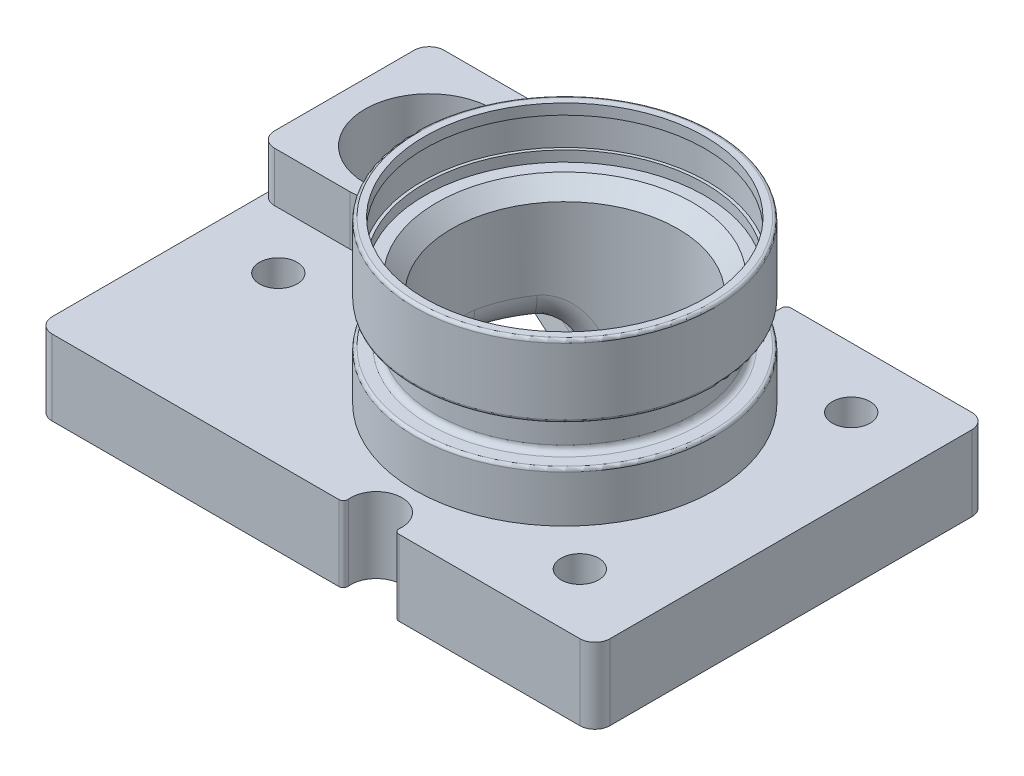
ISO-10303-21;
HEADER;
FILE_DESCRIPTION(('STEP AP214'),'2;1');
FILE_NAME('part.step','',(''),(''),'','','');
FILE_SCHEMA(('AUTOMOTIVE_DESIGN { 1 0 10303 214 1 1 1 1 }'));
ENDSEC;
DATA;
#1=APPLICATION_CONTEXT('core data for automotive mechanical design processes');
#2=APPLICATION_PROTOCOL_DEFINITION('international standard','automotive_design',2000,#1);
#3=PRODUCT_CONTEXT('',#1,'mechanical');
#4=PRODUCT('Part','Part','',(#3));
#5=PRODUCT_RELATED_PRODUCT_CATEGORY('part','',(#4));
#6=PRODUCT_DEFINITION_FORMATION('','',#4);
#7=PRODUCT_DEFINITION_CONTEXT('part definition',#1,'design');
#8=PRODUCT_DEFINITION('design','',#6,#7);
#9=PRODUCT_DEFINITION_SHAPE('','',#8);
#10=(LENGTH_UNIT() NAMED_UNIT(*) SI_UNIT(.MILLI.,.METRE.));
#11=(NAMED_UNIT(*) PLANE_ANGLE_UNIT() SI_UNIT($,.RADIAN.));
#12=(NAMED_UNIT(*) SI_UNIT($,.STERADIAN.) SOLID_ANGLE_UNIT());
#13=UNCERTAINTY_MEASURE_WITH_UNIT(LENGTH_MEASURE(1.E-05),#10,'distance_accuracy_value','');
#14=(GEOMETRIC_REPRESENTATION_CONTEXT(3) GLOBAL_UNCERTAINTY_ASSIGNED_CONTEXT((#13)) GLOBAL_UNIT_ASSIGNED_CONTEXT((#10,
#11,#12)) REPRESENTATION_CONTEXT('',''));
#15=CARTESIAN_POINT('',(0.,0.,0.));
#16=DIRECTION('',(0.,0.,1.));
#17=DIRECTION('',(1.,0.,0.));
#18=AXIS2_PLACEMENT_3D('',#15,#16,#17);
#19=CARTESIAN_POINT('',(15.01,-10.3,-20.));
#20=DIRECTION('',(0.,-1.,0.));
#21=DIRECTION('',(0.,0.,-1.));
#22=AXIS2_PLACEMENT_3D('',#19,#20,#21);
#23=PLANE('',#22);
#24=CARTESIAN_POINT('',(-4.00000000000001,-10.3,4.));
#25=DIRECTION('',(0.,-1.,0.));
#26=DIRECTION('',(0.,0.,-1.));
#27=AXIS2_PLACEMENT_3D('',#24,#25,#26);
#28=CIRCLE('',#27,1.);
#29=CARTESIAN_POINT('',(-4.00000000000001,-10.3,3.));
#30=VERTEX_POINT('',#29);
#31=EDGE_CURVE('E1561',#30,#30,#28,.T.);
#32=ORIENTED_EDGE('',*,*,#31,.F.);
#33=EDGE_LOOP('',(#32));
#34=FACE_BOUND('',#33,.T.);
#35=CARTESIAN_POINT('',(-16.,-10.3,-7.));
#36=DIRECTION('',(0.,-1.,0.));
#37=DIRECTION('',(0.,0.,-1.));
#38=AXIS2_PLACEMENT_3D('',#35,#36,#37);
#39=CIRCLE('',#38,4.24999999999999);
#40=CARTESIAN_POINT('',(-16.3540890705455,-10.3,-2.76477616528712));
#41=VERTEX_POINT('',#40);
#42=CARTESIAN_POINT('',(-13.0328507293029,-10.3,-10.0427824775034));
#43=VERTEX_POINT('',#42);
#44=EDGE_CURVE('E329',#41,#43,#39,.T.);
#45=ORIENTED_EDGE('',*,*,#44,.F.);
#46=DIRECTION('',(0.909750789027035,0.,0.415154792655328));
#47=VECTOR('',#46,1.);
#48=CARTESIAN_POINT('',(3.09476253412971,-10.3,6.11049391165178));
#49=LINE('',#48,#47);
#50=CARTESIAN_POINT('',(-6.6340381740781,-10.3,1.67086243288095));
#51=VERTEX_POINT('',#50);
#52=EDGE_CURVE('E678',#41,#51,#49,.T.);
#53=ORIENTED_EDGE('',*,*,#52,.T.);
#54=CARTESIAN_POINT('',(-5.49994984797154,-10.3,0.0234876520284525));
#55=DIRECTION('',(0.,-1.,0.));
#56=DIRECTION('',(0.,0.,-1.));
#57=AXIS2_PLACEMENT_3D('',#54,#55,#56);
#58=CIRCLE('',#57,2.);
#59=CARTESIAN_POINT('',(-4.79409109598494,-10.3,1.89478758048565));
#60=VERTEX_POINT('',#59);
#61=EDGE_CURVE('E583',#51,#60,#58,.F.);
#62=ORIENTED_EDGE('',*,*,#61,.T.);
#63=CARTESIAN_POINT('',(-4.00000000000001,-10.3,4.));
#64=DIRECTION('',(0.,-1.,0.));
#65=DIRECTION('',(0.,0.,-1.));
#66=AXIS2_PLACEMENT_3D('',#63,#64,#65);
#67=CIRCLE('',#66,2.25);
#68=CARTESIAN_POINT('',(-1.89478758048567,-10.3,4.79409109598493));
#69=VERTEX_POINT('',#68);
#70=EDGE_CURVE('E671',#60,#69,#67,.T.);
#71=ORIENTED_EDGE('',*,*,#70,.T.);
#72=CARTESIAN_POINT('',(-0.0234876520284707,-10.3,5.49994984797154));
#73=DIRECTION('',(0.,-1.,0.));
#74=DIRECTION('',(0.,0.,-1.));
#75=AXIS2_PLACEMENT_3D('',#72,#73,#74);
#76=CIRCLE('',#75,2.);
#77=CARTESIAN_POINT('',(-0.03202861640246,-10.3,7.49993161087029));
#78=VERTEX_POINT('',#77);
#79=EDGE_CURVE('E674',#69,#78,#76,.F.);
#80=ORIENTED_EDGE('',*,*,#79,.T.);
#81=CARTESIAN_POINT('',(0.,-10.3,0.));
#82=DIRECTION('',(0.,-1.,0.));
#83=DIRECTION('',(0.,0.,-1.));
#84=AXIS2_PLACEMENT_3D('',#81,#82,#83);
#85=CIRCLE('',#84,7.5);
#86=CARTESIAN_POINT('',(-3.56792362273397,-10.3,-6.59696301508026));
#87=VERTEX_POINT('',#86);
#88=EDGE_CURVE('E652',#87,#78,#85,.T.);
#89=ORIENTED_EDGE('',*,*,#88,.F.);
#90=CARTESIAN_POINT('',(-4.5193699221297,-10.3,-8.356153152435));
#91=DIRECTION('',(0.,-1.,0.));
#92=DIRECTION('',(0.,0.,-1.));
#93=AXIS2_PLACEMENT_3D('',#90,#91,#92);
#94=CIRCLE('',#93,2.);
#95=CARTESIAN_POINT('',(-5.34967950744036,-10.3,-6.53665157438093));
#96=VERTEX_POINT('',#95);
#97=EDGE_CURVE('E354',#87,#96,#94,.T.);
#98=ORIENTED_EDGE('',*,*,#97,.T.);
#99=DIRECTION('',(-0.909750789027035,0.,-0.415154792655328));
#100=VECTOR('',#99,1.);
#101=CARTESIAN_POINT('',(6.41600087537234,-10.3,-1.16751240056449));
#102=LINE('',#101,#100);
#103=EDGE_CURVE('E586',#96,#43,#102,.T.);
#104=ORIENTED_EDGE('',*,*,#103,.T.);
#105=EDGE_LOOP('',(#45,#53,#62,#71,#80,#89,#98,#104));
#106=FACE_BOUND('',#105,.T.);
#107=CARTESIAN_POINT('',(-17.,-10.3,2.));
#108=DIRECTION('',(0.,-1.,0.));
#109=DIRECTION('',(0.,0.,-1.));
#110=AXIS2_PLACEMENT_3D('',#107,#108,#109);
#111=CIRCLE('',#110,1.25);
#112=CARTESIAN_POINT('',(-17.,-10.3,0.749999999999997));
#113=VERTEX_POINT('',#112);
#114=EDGE_CURVE('E587',#113,#113,#111,.T.);
#115=ORIENTED_EDGE('',*,*,#114,.F.);
#116=EDGE_LOOP('',(#115));
#117=FACE_BOUND('',#116,.T.);
#118=CARTESIAN_POINT('',(10.,-10.3,9.));
#119=DIRECTION('',(0.,-1.,0.));
#120=DIRECTION('',(0.,0.,-1.));
#121=AXIS2_PLACEMENT_3D('',#118,#119,#120);
#122=CIRCLE('',#121,1.25);
#123=CARTESIAN_POINT('',(10.,-10.3,7.75));
#124=VERTEX_POINT('',#123);
#125=EDGE_CURVE('E714',#124,#124,#122,.T.);
#126=ORIENTED_EDGE('',*,*,#125,.F.);
#127=EDGE_LOOP('',(#126));
#128=FACE_BOUND('',#127,.T.);
#129=CARTESIAN_POINT('',(10.,-10.3,-9.));
#130=DIRECTION('',(0.,-1.,0.));
#131=DIRECTION('',(0.,0.,-1.));
#132=AXIS2_PLACEMENT_3D('',#129,#130,#131);
#133=CIRCLE('',#132,1.25);
#134=CARTESIAN_POINT('',(10.,-10.3,-10.25));
#135=VERTEX_POINT('',#134);
#136=EDGE_CURVE('E710',#135,#135,#133,.T.);
#137=ORIENTED_EDGE('',*,*,#136,.F.);
#138=EDGE_LOOP('',(#137));
#139=FACE_BOUND('',#138,.T.);
#140=DIRECTION('',(-1.,0.,0.));
#141=VECTOR('',#140,1.);
#142=CARTESIAN_POINT('',(15.,-10.3,-13.));
#143=LINE('',#142,#141);
#144=CARTESIAN_POINT('',(-1.98997487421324,-10.3,-13.));
#145=VERTEX_POINT('',#144);
#146=CARTESIAN_POINT('',(-21.,-10.3,-13.));
#147=VERTEX_POINT('',#146);
#148=EDGE_CURVE('E763',#145,#147,#143,.T.);
#149=ORIENTED_EDGE('',*,*,#148,.F.);
#150=CARTESIAN_POINT('',(-1.98997487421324,-10.3,-12.7));
#151=DIRECTION('',(0.,-1.,0.));
#152=DIRECTION('',(0.,0.,-1.));
#153=AXIS2_PLACEMENT_3D('',#150,#151,#152);
#154=CIRCLE('',#153,0.3);
#155=CARTESIAN_POINT('',(-1.69147864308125,-10.3,-12.67));
#156=VERTEX_POINT('',#155);
#157=EDGE_CURVE('E798',#145,#156,#154,.T.);
#158=ORIENTED_EDGE('',*,*,#157,.T.);
#159=CARTESIAN_POINT('',(0.,-10.3,-12.5));
#160=DIRECTION('',(0.,-1.,0.));
#161=DIRECTION('',(0.,0.,-1.));
#162=AXIS2_PLACEMENT_3D('',#159,#160,#161);
#163=CIRCLE('',#162,1.7);
#164=CARTESIAN_POINT('',(1.69147864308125,-10.3,-12.67));
#165=VERTEX_POINT('',#164);
#166=EDGE_CURVE('E648',#156,#165,#163,.F.);
#167=ORIENTED_EDGE('',*,*,#166,.T.);
#168=CARTESIAN_POINT('',(1.98997487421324,-10.3,-12.7));
#169=DIRECTION('',(0.,-1.,0.));
#170=DIRECTION('',(0.,0.,-1.));
#171=AXIS2_PLACEMENT_3D('',#168,#169,#170);
#172=CIRCLE('',#171,0.3);
#173=CARTESIAN_POINT('',(1.98997487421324,-10.3,-13.));
#174=VERTEX_POINT('',#173);
#175=EDGE_CURVE('E807',#165,#174,#172,.T.);
#176=ORIENTED_EDGE('',*,*,#175,.T.);
#177=DIRECTION('',(-1.,0.,0.));
#178=VECTOR('',#177,1.);
#179=CARTESIAN_POINT('',(15.,-10.3,-13.));
#180=LINE('',#179,#178);
#181=CARTESIAN_POINT('',(14.,-10.3,-13.));
#182=VERTEX_POINT('',#181);
#183=EDGE_CURVE('E645',#182,#174,#180,.T.);
#184=ORIENTED_EDGE('',*,*,#183,.F.);
#185=CARTESIAN_POINT('',(14.,-10.3,-12.));
#186=DIRECTION('',(0.,-1.,0.));
#187=DIRECTION('',(0.,0.,-1.));
#188=AXIS2_PLACEMENT_3D('',#185,#186,#187);
#189=CIRCLE('',#188,1.);
#190=CARTESIAN_POINT('',(15.,-10.3,-12.));
#191=VERTEX_POINT('',#190);
#192=EDGE_CURVE('E662',#191,#182,#189,.F.);
#193=ORIENTED_EDGE('',*,*,#192,.F.);
#194=DIRECTION('',(0.,0.,-1.));
#195=VECTOR('',#194,1.);
#196=CARTESIAN_POINT('',(15.,-10.3,13.));
#197=LINE('',#196,#195);
#198=CARTESIAN_POINT('',(15.,-10.3,12.));
#199=VERTEX_POINT('',#198);
#200=EDGE_CURVE('E668',#199,#191,#197,.T.);
#201=ORIENTED_EDGE('',*,*,#200,.F.);
#202=CARTESIAN_POINT('',(14.,-10.3,12.));
#203=DIRECTION('',(0.,-1.,0.));
#204=DIRECTION('',(0.,0.,-1.));
#205=AXIS2_PLACEMENT_3D('',#202,#203,#204);
#206=CIRCLE('',#205,1.);
#207=CARTESIAN_POINT('',(14.,-10.3,13.));
#208=VERTEX_POINT('',#207);
#209=EDGE_CURVE('E658',#208,#199,#206,.F.);
#210=ORIENTED_EDGE('',*,*,#209,.F.);
#211=DIRECTION('',(1.,0.,0.));
#212=VECTOR('',#211,1.);
#213=CARTESIAN_POINT('',(0.,-10.3,13.));
#214=LINE('',#213,#212);
#215=CARTESIAN_POINT('',(1.98997487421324,-10.3,13.));
#216=VERTEX_POINT('',#215);
#217=EDGE_CURVE('E637',#216,#208,#214,.T.);
#218=ORIENTED_EDGE('',*,*,#217,.F.);
#219=CARTESIAN_POINT('',(1.98997487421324,-10.3,12.7));
#220=DIRECTION('',(0.,-1.,0.));
#221=DIRECTION('',(0.,0.,-1.));
#222=AXIS2_PLACEMENT_3D('',#219,#220,#221);
#223=CIRCLE('',#222,0.3);
#224=CARTESIAN_POINT('',(1.69147864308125,-10.3,12.67));
#225=VERTEX_POINT('',#224);
#226=EDGE_CURVE('E824',#216,#225,#223,.T.);
#227=ORIENTED_EDGE('',*,*,#226,.T.);
#228=CARTESIAN_POINT('',(0.,-10.3,12.5));
#229=DIRECTION('',(0.,-1.,0.));
#230=DIRECTION('',(0.,0.,-1.));
#231=AXIS2_PLACEMENT_3D('',#228,#229,#230);
#232=CIRCLE('',#231,1.7);
#233=CARTESIAN_POINT('',(-1.69147864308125,-10.3,12.67));
#234=VERTEX_POINT('',#233);
#235=EDGE_CURVE('E643',#225,#234,#232,.F.);
#236=ORIENTED_EDGE('',*,*,#235,.T.);
#237=CARTESIAN_POINT('',(-1.98997487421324,-10.3,12.7));
#238=DIRECTION('',(0.,-1.,0.));
#239=DIRECTION('',(0.,0.,-1.));
#240=AXIS2_PLACEMENT_3D('',#237,#238,#239);
#241=CIRCLE('',#240,0.3);
#242=CARTESIAN_POINT('',(-1.98997487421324,-10.3,13.));
#243=VERTEX_POINT('',#242);
#244=EDGE_CURVE('E97',#234,#243,#241,.T.);
#245=ORIENTED_EDGE('',*,*,#244,.T.);
#246=DIRECTION('',(1.,0.,0.));
#247=VECTOR('',#246,1.);
#248=CARTESIAN_POINT('',(0.,-10.3,13.));
#249=LINE('',#248,#247);
#250=CARTESIAN_POINT('',(-21.,-10.3,13.));
#251=VERTEX_POINT('',#250);
#252=EDGE_CURVE('E654',#251,#243,#249,.T.);
#253=ORIENTED_EDGE('',*,*,#252,.F.);
#254=CARTESIAN_POINT('',(-21.,-10.3,12.));
#255=DIRECTION('',(0.,-1.,0.));
#256=DIRECTION('',(0.,0.,-1.));
#257=AXIS2_PLACEMENT_3D('',#254,#255,#256);
#258=CIRCLE('',#257,1.);
#259=CARTESIAN_POINT('',(-22.,-10.3,12.));
#260=VERTEX_POINT('',#259);
#261=EDGE_CURVE('E655',#260,#251,#258,.F.);
#262=ORIENTED_EDGE('',*,*,#261,.F.);
#263=DIRECTION('',(0.,0.,1.));
#264=VECTOR('',#263,1.);
#265=CARTESIAN_POINT('',(-22.,-10.3,13.));
#266=LINE('',#265,#264);
#267=CARTESIAN_POINT('',(-22.,-10.3,-12.));
#268=VERTEX_POINT('',#267);
#269=EDGE_CURVE('E665',#268,#260,#266,.T.);
#270=ORIENTED_EDGE('',*,*,#269,.F.);
#271=CARTESIAN_POINT('',(-21.,-10.3,-12.));
#272=DIRECTION('',(0.,-1.,0.));
#273=DIRECTION('',(0.,0.,-1.));
#274=AXIS2_PLACEMENT_3D('',#271,#272,#273);
#275=CIRCLE('',#274,1.);
#276=EDGE_CURVE('E660',#147,#268,#275,.F.);
#277=ORIENTED_EDGE('',*,*,#276,.F.);
#278=EDGE_LOOP('',(#149,#158,#167,#176,#184,#193,#201,#210,#218,#227,#236,#245,#253,#262,#270,#277));
#279=FACE_BOUND('',#278,.T.);
#280=ADVANCED_FACE('F82',(#34,#106,#117,#128,#139,#279),#23,.T.);
#281=CARTESIAN_POINT('',(-4.00000000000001,-9.3,4.));
#282=DIRECTION('',(0.,1.,0.));
#283=DIRECTION('',(0.,0.,1.));
#284=AXIS2_PLACEMENT_3D('',#281,#282,#283);
#285=PLANE('',#284);
#286=CARTESIAN_POINT('',(-4.00000000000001,-9.3,4.));
#287=DIRECTION('',(0.,1.,0.));
#288=DIRECTION('',(0.,0.,1.));
#289=AXIS2_PLACEMENT_3D('',#286,#287,#288);
#290=CIRCLE('',#289,1.);
#291=CARTESIAN_POINT('',(-4.00000000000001,-9.3,5.));
#292=VERTEX_POINT('',#291);
#293=EDGE_CURVE('E1564',#292,#292,#290,.T.);
#294=ORIENTED_EDGE('',*,*,#293,.F.);
#295=EDGE_LOOP('',(#294));
#296=FACE_BOUND('',#295,.T.);
#297=CARTESIAN_POINT('',(-5.49994984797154,-9.3,0.0234876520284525));
#298=DIRECTION('',(0.,1.,0.));
#299=DIRECTION('',(0.,0.,1.));
#300=AXIS2_PLACEMENT_3D('',#297,#298,#299);
#301=CIRCLE('',#300,2.);
#302=CARTESIAN_POINT('',(-4.79409109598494,-9.3,1.89478758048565));
#303=VERTEX_POINT('',#302);
#304=CARTESIAN_POINT('',(-6.6340381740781,-9.3,1.67086243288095));
#305=VERTEX_POINT('',#304);
#306=EDGE_CURVE('E582',#303,#305,#301,.F.);
#307=ORIENTED_EDGE('',*,*,#306,.T.);
#308=DIRECTION('',(-0.909750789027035,0.,-0.415154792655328));
#309=VECTOR('',#308,1.);
#310=CARTESIAN_POINT('',(-3.57429979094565,-9.3,3.06714047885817));
#311=LINE('',#310,#309);
#312=CARTESIAN_POINT('',(-8.26400017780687,-9.3,0.927047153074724));
#313=VERTEX_POINT('',#312);
#314=EDGE_CURVE('E591',#305,#313,#311,.T.);
#315=ORIENTED_EDGE('',*,*,#314,.T.);
#316=CARTESIAN_POINT('',(-9.09430976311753,-9.3,2.74654873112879));
#317=DIRECTION('',(0.,1.,0.));
#318=DIRECTION('',(0.,0.,1.));
#319=AXIS2_PLACEMENT_3D('',#316,#317,#318);
#320=CIRCLE('',#319,2.);
#321=CARTESIAN_POINT('',(-7.17971823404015,-9.3,2.16832794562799));
#322=VERTEX_POINT('',#321);
#323=EDGE_CURVE('E319',#313,#322,#320,.F.);
#324=ORIENTED_EDGE('',*,*,#323,.T.);
#325=CARTESIAN_POINT('',(0.,-9.3,0.));
#326=DIRECTION('',(0.,1.,0.));
#327=DIRECTION('',(0.,0.,1.));
#328=AXIS2_PLACEMENT_3D('',#325,#326,#327);
#329=CIRCLE('',#328,7.5);
#330=CARTESIAN_POINT('',(-0.03202861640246,-9.3,7.49993161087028));
#331=VERTEX_POINT('',#330);
#332=EDGE_CURVE('E603',#322,#331,#329,.T.);
#333=ORIENTED_EDGE('',*,*,#332,.T.);
#334=CARTESIAN_POINT('',(-0.0234876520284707,-9.3,5.49994984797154));
#335=DIRECTION('',(0.,1.,0.));
#336=DIRECTION('',(0.,0.,1.));
#337=AXIS2_PLACEMENT_3D('',#334,#335,#336);
#338=CIRCLE('',#337,2.);
#339=CARTESIAN_POINT('',(-1.89478758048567,-9.3,4.79409109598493));
#340=VERTEX_POINT('',#339);
#341=EDGE_CURVE('E595',#331,#340,#338,.F.);
#342=ORIENTED_EDGE('',*,*,#341,.T.);
#343=CARTESIAN_POINT('',(-4.00000000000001,-9.3,4.));
#344=DIRECTION('',(0.,1.,0.));
#345=DIRECTION('',(0.,0.,1.));
#346=AXIS2_PLACEMENT_3D('',#343,#344,#345);
#347=CIRCLE('',#346,2.25);
#348=EDGE_CURVE('E593',#340,#303,#347,.T.);
#349=ORIENTED_EDGE('',*,*,#348,.T.);
#350=EDGE_LOOP('',(#307,#315,#324,#333,#342,#349));
#351=FACE_BOUND('',#350,.T.);
#352=ADVANCED_FACE('F508',(#296,#351),#285,.T.);
#353=CARTESIAN_POINT('',(-5.49994984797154,-9.3,0.0234876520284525));
#354=DIRECTION('',(0.,-1.,0.));
#355=DIRECTION('',(0.,0.,-1.));
#356=AXIS2_PLACEMENT_3D('',#353,#354,#355);
#357=CYLINDRICAL_SURFACE('',#356,2.);
#358=DIRECTION('',(0.,-1.,0.));
#359=VECTOR('',#358,1.);
#360=CARTESIAN_POINT('',(-6.6340381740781,-6.3,1.67086243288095));
#361=LINE('',#360,#359);
#362=EDGE_CURVE('E579',#305,#51,#361,.T.);
#363=ORIENTED_EDGE('',*,*,#362,.F.);
#364=ORIENTED_EDGE('',*,*,#306,.F.);
#365=DIRECTION('',(0.,-1.,0.));
#366=VECTOR('',#365,1.);
#367=CARTESIAN_POINT('',(-4.79409109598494,-9.3,1.89478758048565));
#368=LINE('',#367,#366);
#369=EDGE_CURVE('E594',#60,#303,#368,.F.);
#370=ORIENTED_EDGE('',*,*,#369,.F.);
#371=ORIENTED_EDGE('',*,*,#61,.F.);
#372=EDGE_LOOP('',(#363,#364,#370,#371));
#373=FACE_BOUND('',#372,.T.);
#374=ADVANCED_FACE('F514',(#373),#357,.F.);
#375=CARTESIAN_POINT('',(0.,0.,0.));
#376=DIRECTION('',(0.,-1.,0.));
#377=DIRECTION('',(0.,0.,-1.));
#378=AXIS2_PLACEMENT_3D('',#375,#376,#377);
#379=CYLINDRICAL_SURFACE('',#378,7.5);
#380=CARTESIAN_POINT('',(0.,0.999999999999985,0.));
#381=DIRECTION('',(0.,-1.,0.));
#382=DIRECTION('',(0.,0.,-1.));
#383=AXIS2_PLACEMENT_3D('',#380,#381,#382);
#384=CIRCLE('',#383,7.5);
#385=CARTESIAN_POINT('',(0.,0.999999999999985,-7.5));
#386=VERTEX_POINT('',#385);
#387=EDGE_CURVE('E683',#386,#386,#384,.F.);
#388=ORIENTED_EDGE('',*,*,#387,.T.);
#389=EDGE_LOOP('',(#388));
#390=FACE_BOUND('',#389,.T.);
#391=DIRECTION('',(0.,-1.,0.));
#392=VECTOR('',#391,1.);
#393=CARTESIAN_POINT('',(-7.17971823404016,0.,2.168327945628));
#394=LINE('',#393,#392);
#395=CARTESIAN_POINT('',(-7.17971823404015,-8.3,2.168327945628));
#396=VERTEX_POINT('',#395);
#397=EDGE_CURVE('E352',#322,#396,#394,.F.);
#398=ORIENTED_EDGE('',*,*,#397,.T.);
#399=CARTESIAN_POINT('',(-8.32162024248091,-8.74239179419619,0.846297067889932));
#400=CARTESIAN_POINT('',(-7.45922098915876,-8.91402761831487,1.19705217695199));
#401=CARTESIAN_POINT('',(-7.20897044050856,-9.18478358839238,2.06899617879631));
#402=CARTESIAN_POINT('',(-8.3123304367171,-8.70652130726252,0.859481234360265));
#403=CARTESIAN_POINT('',(-7.45642359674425,-8.86502436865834,1.21419804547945));
#404=CARTESIAN_POINT('',(-7.20430351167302,-9.11304261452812,2.08524935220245));
#405=CARTESIAN_POINT('',(-8.30405827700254,-8.6702871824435,0.871143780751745));
#406=CARTESIAN_POINT('',(-7.45387916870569,-8.81516915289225,1.22941586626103));
#407=CARTESIAN_POINT('',(-7.20012474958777,-9.04057436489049,2.09961044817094));
#408=CARTESIAN_POINT('',(-8.28971619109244,-8.59723647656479,0.89127904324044));
#409=CARTESIAN_POINT('',(-7.44941600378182,-8.71427919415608,1.25570341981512));
#410=CARTESIAN_POINT('',(-7.19285436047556,-8.89447295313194,2.12438675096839));
#411=CARTESIAN_POINT('',(-8.28364645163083,-8.56041984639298,0.89975148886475));
#412=CARTESIAN_POINT('',(-7.44749464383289,-8.6632145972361,1.26678949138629));
#413=CARTESIAN_POINT('',(-7.18976282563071,-8.82083969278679,2.13480162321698));
#414=CARTESIAN_POINT('',(-8.26901739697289,-8.44950431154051,0.920127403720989));
#415=CARTESIAN_POINT('',(-7.44284241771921,-8.50910456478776,1.29342491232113));
#416=CARTESIAN_POINT('',(-7.18229859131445,-8.59900862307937,2.1598395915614));
#417=CARTESIAN_POINT('',(-8.26399106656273,-8.37476237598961,0.927055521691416));
#418=CARTESIAN_POINT('',(-7.44119098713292,-8.40449346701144,1.30253996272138));
#419=CARTESIAN_POINT('',(-7.17971229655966,-8.44952475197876,2.16833730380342));
#420=CARTESIAN_POINT('',(-8.26401189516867,-8.20385310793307,0.927036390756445));
#421=CARTESIAN_POINT('',(-7.44120556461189,-8.16561769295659,1.30250390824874));
#422=CARTESIAN_POINT('',(-7.17972586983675,-8.10770621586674,2.1683159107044));
#423=CARTESIAN_POINT('',(-8.27235163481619,-8.10767240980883,0.915553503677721));
#424=CARTESIAN_POINT('',(-7.44395686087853,-8.03088536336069,1.28737538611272));
#425=CARTESIAN_POINT('',(-7.18402074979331,-7.91534481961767,2.15423419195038));
#426=CARTESIAN_POINT('',(-8.30426295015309,-7.91872110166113,0.870913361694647));
#427=CARTESIAN_POINT('',(-7.45398611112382,-7.76910469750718,1.22904796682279));
#428=CARTESIAN_POINT('',(-7.20024547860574,-7.53744220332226,2.0993390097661));
#429=CARTESIAN_POINT('',(-8.32784567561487,-7.82595304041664,0.837740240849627));
#430=CARTESIAN_POINT('',(-7.46130945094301,-7.64152782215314,1.18557602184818));
#431=CARTESIAN_POINT('',(-7.2121809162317,-7.35190608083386,2.05850597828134));
#432=CARTESIAN_POINT('',(-8.38639759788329,-7.64703157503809,0.753235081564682));
#433=CARTESIAN_POINT('',(-7.47807810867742,-7.40025577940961,1.07604948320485));
#434=CARTESIAN_POINT('',(-7.24117592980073,-6.99406315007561,1.9540339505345));
#435=CARTESIAN_POINT('',(-8.42127396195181,-7.56083108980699,0.702050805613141));
#436=CARTESIAN_POINT('',(-7.48755608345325,-7.28611114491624,1.00977757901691));
#437=CARTESIAN_POINT('',(-7.25819364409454,-6.82166217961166,1.89058047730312));
#438=CARTESIAN_POINT('',(-8.49841869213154,-7.3954391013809,0.584910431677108));
#439=CARTESIAN_POINT('',(-7.50611612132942,-7.07332157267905,0.860176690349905));
#440=CARTESIAN_POINT('',(-7.29466610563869,-6.49087820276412,1.74456368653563));
#441=CARTESIAN_POINT('',(-8.540692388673,-7.31625271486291,0.518943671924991));
#442=CARTESIAN_POINT('',(-7.51522099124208,-6.97455615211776,0.776403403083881));
#443=CARTESIAN_POINT('',(-7.31412260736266,-6.33250542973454,1.661986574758));
#444=CARTESIAN_POINT('',(-8.63467446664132,-7.15562733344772,0.365835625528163));
#445=CARTESIAN_POINT('',(-7.53183242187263,-6.78209605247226,0.58523504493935));
#446=CARTESIAN_POINT('',(-7.35545411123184,-6.01125466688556,1.46909325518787));
#447=CARTESIAN_POINT('',(-8.68689267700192,-7.07525949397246,0.277051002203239));
#448=CARTESIAN_POINT('',(-7.53892356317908,-6.69105185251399,0.475863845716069));
#449=CARTESIAN_POINT('',(-7.37731098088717,-5.8505189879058,1.35655792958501));
#450=CARTESIAN_POINT('',(-8.79143154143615,-6.92486077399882,0.0879631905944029));
#451=CARTESIAN_POINT('',(-7.54748120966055,-6.53195613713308,0.249378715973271));
#452=CARTESIAN_POINT('',(-7.41768499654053,-5.54972154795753,1.11489793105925));
#453=CARTESIAN_POINT('',(-8.84375223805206,-6.85483609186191,-0.0123468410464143));
#454=CARTESIAN_POINT('',(-7.54883883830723,-6.46422583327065,0.131877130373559));
#455=CARTESIAN_POINT('',(-7.43620014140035,-5.40967218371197,0.985763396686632));
#456=CARTESIAN_POINT('',(-8.95526165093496,-6.71226059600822,-0.243608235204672));
#457=CARTESIAN_POINT('',(-7.54444269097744,-6.34011962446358,-0.129344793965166));
#458=CARTESIAN_POINT('',(-7.47045061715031,-5.12452119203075,0.68533046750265));
#459=CARTESIAN_POINT('',(-9.01360447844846,-6.64223323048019,-0.376585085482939));
#460=CARTESIAN_POINT('',(-7.53691025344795,-6.29017264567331,-0.27291652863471));
#461=CARTESIAN_POINT('',(-7.4847990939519,-4.98446646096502,0.510857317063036));
#462=CARTESIAN_POINT('',(-9.11927969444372,-6.51985595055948,-0.650969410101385));
#463=CARTESIAN_POINT('',(-7.5131051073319,-6.22268929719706,-0.549974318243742));
#464=CARTESIAN_POINT('',(-7.50079162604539,-4.73971190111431,0.146463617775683));
#465=CARTESIAN_POINT('',(-9.16660863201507,-6.46751157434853,-0.79237950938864));
#466=CARTESIAN_POINT('',(-7.49658942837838,-6.20612760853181,-0.683035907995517));
#467=CARTESIAN_POINT('',(-7.50243170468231,-4.6350231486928,-0.043461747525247));
#468=CARTESIAN_POINT('',(-9.24607552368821,-6.38223953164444,-1.08110178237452));
#469=CARTESIAN_POINT('',(-7.4590288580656,-6.19979651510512,-0.931214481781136));
#470=CARTESIAN_POINT('',(-7.48989211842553,-4.46447906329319,-0.436358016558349));
#471=CARTESIAN_POINT('',(-9.27802012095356,-6.34955778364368,-1.22846506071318));
#472=CARTESIAN_POINT('',(-7.43789020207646,-6.21113221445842,-1.0450037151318));
#473=CARTESIAN_POINT('',(-7.47551825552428,-4.39911556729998,-0.639460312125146));
#474=CARTESIAN_POINT('',(-9.31124859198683,-6.31782820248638,-1.4482799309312));
#475=CARTESIAN_POINT('',(-7.40812543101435,-6.2408168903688,-1.19717478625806));
#476=CARTESIAN_POINT('',(-7.44072947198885,-4.33565640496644,-0.946718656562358));
#477=CARTESIAN_POINT('',(-9.3198765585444,-6.31013376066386,-1.52133980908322));
#478=CARTESIAN_POINT('',(-7.39848307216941,-6.2529552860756,-1.24499107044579));
#479=CARTESIAN_POINT('',(-7.42693044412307,-4.32026752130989,-1.04956256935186));
#480=CARTESIAN_POINT('',(-9.33204679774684,-6.30075545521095,-1.66639430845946));
#481=CARTESIAN_POINT('',(-7.3805281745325,-6.28006766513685,-1.33532562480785));
#482=CARTESIAN_POINT('',(-7.3949429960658,-4.3015109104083,-1.25522978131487));
#483=CARTESIAN_POINT('',(-9.3355923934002,-6.29906766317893,-1.73838959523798));
#484=CARTESIAN_POINT('',(-7.3722470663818,-6.29503678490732,-1.37769800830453));
#485=CARTESIAN_POINT('',(-7.37675745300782,-4.29813532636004,-1.35805304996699));
#486=CARTESIAN_POINT('',(-9.33740174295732,-6.30173456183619,-1.87166165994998));
#487=CARTESIAN_POINT('',(-7.35840611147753,-6.32454388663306,-1.45321693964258));
#488=CARTESIAN_POINT('',(-7.33869378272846,-4.30346912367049,-1.5498089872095));
#489=CARTESIAN_POINT('',(-9.33627151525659,-6.30535879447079,-1.93315135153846));
#490=CARTESIAN_POINT('',(-7.35265255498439,-6.33889216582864,-1.48678949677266));
#491=CARTESIAN_POINT('',(-7.31931306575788,-4.31071758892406,-1.63886816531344));
#492=CARTESIAN_POINT('',(-9.3301406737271,-6.31744848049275,-2.05425943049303));
#493=CARTESIAN_POINT('',(-7.34255823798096,-6.36821140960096,-1.55188489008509));
#494=CARTESIAN_POINT('',(-7.27752740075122,-4.33489696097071,-1.81544050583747));
#495=CARTESIAN_POINT('',(-9.32514061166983,-6.32591324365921,-2.11387808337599));
#496=CARTESIAN_POINT('',(-7.33823367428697,-6.38315507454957,-1.58333277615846));
#497=CARTESIAN_POINT('',(-7.25512288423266,-4.35182648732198,-1.90295388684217));
#498=CARTESIAN_POINT('',(-9.31141505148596,-6.34777012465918,-2.23108843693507));
#499=CARTESIAN_POINT('',(-7.33077137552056,-6.41353061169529,-1.64559876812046));
#500=CARTESIAN_POINT('',(-7.20747018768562,-4.39554024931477,-2.07616683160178));
#501=CARTESIAN_POINT('',(-9.30266968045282,-6.36118847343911,-2.28866752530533));
#502=CARTESIAN_POINT('',(-7.32765079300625,-6.42893355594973,-1.67634504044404));
#503=CARTESIAN_POINT('',(-7.18220737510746,-4.42237694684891,-2.16185412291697));
#504=CARTESIAN_POINT('',(-9.28177965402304,-6.39289338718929,-2.40106404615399));
#505=CARTESIAN_POINT('',(-7.3221582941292,-6.46047285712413,-1.73815323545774));
#506=CARTESIAN_POINT('',(-7.12935902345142,-4.48578677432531,-2.33025754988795));
#507=CARTESIAN_POINT('',(-9.26963352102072,-6.41118206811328,-2.45588026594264));
#508=CARTESIAN_POINT('',(-7.31979239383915,-6.4765780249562,-1.76915328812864));
#509=CARTESIAN_POINT('',(-7.10177247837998,-4.52236413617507,-2.41297237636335));
#510=CARTESIAN_POINT('',(-9.25595559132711,-6.43187351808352,-2.50909200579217));
#511=CARTESIAN_POINT('',(-7.31755503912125,-6.49321816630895,-1.80089688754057));
#512=CARTESIAN_POINT('',(-7.07324660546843,-4.56374703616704,-2.49382887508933));
#513=(BOUNDED_SURFACE() B_SPLINE_SURFACE(3,2,((#399,#400,#401),(#402,#403,#404),(#405,#406,
#407),(#408,#409,#410),(#411,#412,#413),(#414,#415,#416),(#417,#418,#419),(#420,#421,#422),
(#423,#424,#425),(#426,#427,#428),(#429,#430,#431),(#432,#433,#434),(#435,#436,#437),(#438,#439,
#440),(#441,#442,#443),(#444,#445,#446),(#447,#448,#449),(#450,#451,#452),(#453,#454,#455),
(#456,#457,#458),(#459,#460,#461),(#462,#463,#464),(#465,#466,#467),(#468,#469,#470),(#471,#472,
#473),(#474,#475,#476),(#477,#478,#479),(#480,#481,#482),(#483,#484,#485),(#486,#487,#488),
(#489,#490,#491),(#492,#493,#494),(#495,#496,#497),(#498,#499,#500),(#501,#502,#503),(#504,#505,
#506),(#507,#508,#509),(#510,#511,#512)),.UNSPECIFIED.,.F.,.F.,
.F.) B_SPLINE_SURFACE_WITH_KNOTS((4,2,2,2,2,2,2,2,2,2,2,2,2,2,2,2,2,2,4),(3,3),(0.,
0.224538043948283,0.44909512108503,0.897108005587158,1.4732674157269,2.04984874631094,
2.62180607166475,3.19417725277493,3.84175551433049,4.48972029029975,5.27293177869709,
6.05638833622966,6.84945014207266,7.24590731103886,7.64210514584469,7.98867113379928,
8.33518771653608,8.68356617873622,9.03209624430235),(0.,1.),
.UNSPECIFIED.) GEOMETRIC_REPRESENTATION_ITEM() RATIONAL_B_SPLINE_SURFACE(((1.,0.903856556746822,
1.),(1.,0.905050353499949,1.),(1.,0.906106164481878,1.),(1.,0.907928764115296,1.),(1.,
0.908695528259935,1.),(1.,0.910539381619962,1.),(1.,0.91116601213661,1.),(1.,0.911164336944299,
1.),(1.,0.910125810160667,1.),(1.,0.906085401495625,1.),(1.,0.903082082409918,1.),(1.,
0.89542865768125,1.),(1.,0.890791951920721,1.),(1.,0.880194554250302,1.),(1.,0.874232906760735,
1.),(1.,0.860456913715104,1.),(1.,0.852502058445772,1.),(1.,0.835752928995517,1.),(1.,
0.826958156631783,1.),(1.,0.807103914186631,1.),(1.,0.795954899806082,1.),(1.,0.774007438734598,
1.),(1.,0.763209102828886,1.),(1.,0.742913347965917,1.),(1.,0.733433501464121,1.),(1.,
0.721211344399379,1.),(1.,0.717470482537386,1.),(1.,0.710774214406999,1.),(1.,0.707818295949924,
1.),(1.,0.703103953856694,1.),(1.,0.701241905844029,1.),(1.,0.698229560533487,1.),(1.,
0.697079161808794,1.),(1.,0.695495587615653,1.),(1.,0.695066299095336,1.),(1.,0.694905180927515,
1.),(1.,0.695173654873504,1.),(1.,0.695775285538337,1.))) REPRESENTATION_ITEM('') SURFACE());
#514=CARTESIAN_POINT('',(-7.07324660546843,-4.56374703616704,-2.49382887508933));
#515=CARTESIAN_POINT('',(-7.10177247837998,-4.52236413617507,-2.41297237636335));
#516=CARTESIAN_POINT('',(-7.12935902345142,-4.4857867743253,-2.33025754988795));
#517=CARTESIAN_POINT('',(-7.18220737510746,-4.4223769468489,-2.16185412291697));
#518=CARTESIAN_POINT('',(-7.20747018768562,-4.39554024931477,-2.07616683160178));
#519=CARTESIAN_POINT('',(-7.25512288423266,-4.35182648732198,-1.90295388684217));
#520=CARTESIAN_POINT('',(-7.27752740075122,-4.33489696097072,-1.81544050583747));
#521=CARTESIAN_POINT('',(-7.31931306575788,-4.31071758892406,-1.63886816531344));
#522=CARTESIAN_POINT('',(-7.33869378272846,-4.30346912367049,-1.5498089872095));
#523=CARTESIAN_POINT('',(-7.37675745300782,-4.29813532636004,-1.35805304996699));
#524=CARTESIAN_POINT('',(-7.39494299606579,-4.3015109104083,-1.25522978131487));
#525=CARTESIAN_POINT('',(-7.42693044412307,-4.32026752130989,-1.04956256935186));
#526=CARTESIAN_POINT('',(-7.44072947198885,-4.33565640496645,-0.946718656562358));
#527=CARTESIAN_POINT('',(-7.47551825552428,-4.39911556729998,-0.639460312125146));
#528=CARTESIAN_POINT('',(-7.48989211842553,-4.46447906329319,-0.436358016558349));
#529=CARTESIAN_POINT('',(-7.50243170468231,-4.6350231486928,-0.0434617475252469));
#530=CARTESIAN_POINT('',(-7.50079162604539,-4.73971190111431,0.146463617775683));
#531=CARTESIAN_POINT('',(-7.4847990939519,-4.98446646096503,0.510857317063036));
#532=CARTESIAN_POINT('',(-7.47045061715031,-5.12452119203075,0.68533046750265));
#533=CARTESIAN_POINT('',(-7.43620014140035,-5.40967218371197,0.985763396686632));
#534=CARTESIAN_POINT('',(-7.41768499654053,-5.54972154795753,1.11489793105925));
#535=CARTESIAN_POINT('',(-7.37731098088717,-5.8505189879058,1.35655792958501));
#536=CARTESIAN_POINT('',(-7.35545411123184,-6.01125466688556,1.46909325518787));
#537=CARTESIAN_POINT('',(-7.31412260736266,-6.33250542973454,1.661986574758));
#538=CARTESIAN_POINT('',(-7.29466610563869,-6.49087820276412,1.74456368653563));
#539=CARTESIAN_POINT('',(-7.25819364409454,-6.82166217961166,1.89058047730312));
#540=CARTESIAN_POINT('',(-7.24117592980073,-6.99406315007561,1.9540339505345));
#541=CARTESIAN_POINT('',(-7.2121809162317,-7.35190608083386,2.05850597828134));
#542=CARTESIAN_POINT('',(-7.20024547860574,-7.53744220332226,2.0993390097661));
#543=CARTESIAN_POINT('',(-7.18402074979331,-7.91534481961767,2.15423419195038));
#544=CARTESIAN_POINT('',(-7.17972586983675,-8.10770621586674,2.1683159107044));
#545=CARTESIAN_POINT('',(-7.17971229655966,-8.44952475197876,2.16833730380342));
#546=CARTESIAN_POINT('',(-7.18229859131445,-8.59900862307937,2.1598395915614));
#547=CARTESIAN_POINT('',(-7.18976282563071,-8.82083969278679,2.13480162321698));
#548=CARTESIAN_POINT('',(-7.19285436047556,-8.89447295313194,2.12438675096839));
#549=CARTESIAN_POINT('',(-7.20012474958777,-9.04057436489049,2.09961044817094));
#550=CARTESIAN_POINT('',(-7.20430351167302,-9.11304261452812,2.08524935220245));
#551=CARTESIAN_POINT('',(-7.20897044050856,-9.18478358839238,2.06899617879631));
#552=B_SPLINE_CURVE_WITH_KNOTS('',3,(#514,#515,#516,#517,#518,#519,#520,#521,#522,#523,#524,
#525,#526,#527,#528,#529,#530,#531,#532,#533,#534,#535,#536,#537,#538,#539,#540,#541,#542,#543,
#544,#545,#546,#547,#548,#549,#550,#551),.UNSPECIFIED.,.F.,.F.,(4,2,2,2,2,2,2,2,2,2,2,2,2,2,2,2,
2,2,4),(0.,0.348530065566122,0.696908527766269,1.04342511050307,1.38999109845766,
1.78618893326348,2.18264610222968,2.97570790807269,3.75916446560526,4.54237595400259,
5.19034072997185,5.83791899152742,6.4102901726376,6.9822474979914,7.55882882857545,
8.13498823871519,8.58300112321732,8.80755820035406,9.03209624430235),.UNSPECIFIED.);
#553=CARTESIAN_POINT('',(-7.37011982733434,-4.3,-1.3897243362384));
#554=VERTEX_POINT('',#553);
#555=EDGE_CURVE('E364',#396,#554,#552,.F.);
#556=ORIENTED_EDGE('',*,*,#555,.T.);
#557=CARTESIAN_POINT('',(0.,-4.3,0.));
#558=DIRECTION('',(0.,1.,0.));
#559=DIRECTION('',(0.,0.,1.));
#560=AXIS2_PLACEMENT_3D('',#557,#558,#559);
#561=CIRCLE('',#560,7.5);
#562=CARTESIAN_POINT('',(-6.14397185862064,-4.3,-4.30134976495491));
#563=VERTEX_POINT('',#562);
#564=EDGE_CURVE('E719',#554,#563,#561,.F.);
#565=ORIENTED_EDGE('',*,*,#564,.T.);
#566=CARTESIAN_POINT('',(-8.17102458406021,-6.39773905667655,-4.94689351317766));
#567=CARTESIAN_POINT('',(-6.36392492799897,-6.42856646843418,-4.01786937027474));
#568=CARTESIAN_POINT('',(-6.65322259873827,-4.4954781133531,-3.46188229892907));
#569=CARTESIAN_POINT('',(-8.1454917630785,-6.38144506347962,-4.99038260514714));
#570=CARTESIAN_POINT('',(-6.34445803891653,-6.41644043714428,-4.04085334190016));
#571=CARTESIAN_POINT('',(-6.61662356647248,-4.46289012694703,-3.53224501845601));
#572=CARTESIAN_POINT('',(-8.11817183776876,-6.36716322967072,-5.03372368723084));
#573=CARTESIAN_POINT('',(-6.32555295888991,-6.40481869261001,-4.06341621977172));
#574=CARTESIAN_POINT('',(-6.57841462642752,-4.43432645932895,-3.60292704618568));
#575=CARTESIAN_POINT('',(-8.06003279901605,-6.3426729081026,-5.11970509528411));
#576=CARTESIAN_POINT('',(-6.28841342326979,-6.38226820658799,-4.10866386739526));
#577=CARTESIAN_POINT('',(-6.49896704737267,-4.38534581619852,-3.74432336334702));
#578=CARTESIAN_POINT('',(-8.02921456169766,-6.33246340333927,-5.16234559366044));
#579=CARTESIAN_POINT('',(-6.27021015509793,-6.37135843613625,-4.13131075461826));
#580=CARTESIAN_POINT('',(-6.45772916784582,-4.36492680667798,-3.81503764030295));
#581=CARTESIAN_POINT('',(-7.96424933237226,-6.31618569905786,-5.24640317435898));
#582=CARTESIAN_POINT('',(-6.2341725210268,-6.35000556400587,-4.1774965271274));
#583=CARTESIAN_POINT('',(-6.37253729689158,-4.33237139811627,-3.95569350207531));
#584=CARTESIAN_POINT('',(-7.93011375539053,-6.31010383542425,-5.28782385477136));
#585=CARTESIAN_POINT('',(-6.2163679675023,-6.3395789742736,-4.20099086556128));
#586=CARTESIAN_POINT('',(-6.3285927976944,-4.32020767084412,-4.02563687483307));
#587=CARTESIAN_POINT('',(-7.85861756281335,-6.30200894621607,-5.36923713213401));
#588=CARTESIAN_POINT('',(-6.18051270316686,-6.31928736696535,-4.2497067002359));
#589=CARTESIAN_POINT('',(-6.23814470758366,-4.3040178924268,-4.16442469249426));
#590=CARTESIAN_POINT('',(-7.821256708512,-6.29999622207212,-5.40922962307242));
#591=CARTESIAN_POINT('',(-6.16249323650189,-6.30943795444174,-4.27488161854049));
#592=CARTESIAN_POINT('',(-6.19164092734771,-4.29999244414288,-4.23326905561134));
#593=CARTESIAN_POINT('',(-7.69755698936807,-6.30000823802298,-5.53373845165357));
#594=CARTESIAN_POINT('',(-6.10388541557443,-6.27957311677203,-4.35863566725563));
#595=CARTESIAN_POINT('',(-6.04002628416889,-4.30001647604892,-4.44980427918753));
#596=CARTESIAN_POINT('',(-7.60546754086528,-6.30960468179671,-5.61507912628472));
#597=CARTESIAN_POINT('',(-6.06167571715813,-6.26118505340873,-4.42164979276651));
#598=CARTESIAN_POINT('',(-5.93053991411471,-4.31920936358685,-4.59462771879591));
#599=CARTESIAN_POINT('',(-7.4103202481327,-6.34685091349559,-5.76727287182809));
#600=CARTESIAN_POINT('',(-5.9666429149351,-6.23575387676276,-4.56190061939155));
#601=CARTESIAN_POINT('',(-5.70454259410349,-4.39370182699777,-4.87241275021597));
#602=CARTESIAN_POINT('',(-7.30725403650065,-6.37451455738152,-5.83811784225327));
#603=CARTESIAN_POINT('',(-5.91427491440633,-6.22860662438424,-4.63848862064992));
#604=CARTESIAN_POINT('',(-5.58802631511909,-4.44902911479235,-5.00536514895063));
#605=CARTESIAN_POINT('',(-7.09486487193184,-6.44609856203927,-5.96810211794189));
#606=CARTESIAN_POINT('',(-5.79646796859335,-6.23387443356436,-4.80173677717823));
#607=CARTESIAN_POINT('',(-5.35269320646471,-4.59219712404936,-5.25624568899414));
#608=CARTESIAN_POINT('',(-6.98557282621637,-6.48994368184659,-6.02729368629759));
#609=CARTESIAN_POINT('',(-5.73159328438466,-6.24578423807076,-4.8878184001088));
#610=CARTESIAN_POINT('',(-5.23388939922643,-4.67988736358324,-5.37424002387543));
#611=CARTESIAN_POINT('',(-6.7647855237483,-6.59230349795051,-6.13442936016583));
#612=CARTESIAN_POINT('',(-5.59024115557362,-6.29454977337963,-5.06352027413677));
#613=CARTESIAN_POINT('',(-4.99759632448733,-4.88460699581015,-5.59465690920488));
#614=CARTESIAN_POINT('',(-6.6532892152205,-6.65082536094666,-6.18236794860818));
#615=CARTESIAN_POINT('',(-5.51413475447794,-6.33081056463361,-5.15292197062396));
#616=CARTESIAN_POINT('',(-4.88010772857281,-5.00165072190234,-5.69707181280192));
#617=CARTESIAN_POINT('',(-6.42355065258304,-6.7866841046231,-6.27126486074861));
#618=CARTESIAN_POINT('',(-5.34850997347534,-6.43487306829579,-5.3354261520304));
#619=CARTESIAN_POINT('',(-4.64096821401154,-5.2733682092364,-5.89384141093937));
#620=CARTESIAN_POINT('',(-6.30553876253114,-6.86519613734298,-6.31128572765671));
#621=CARTESIAN_POINT('',(-5.25839445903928,-6.50445291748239,-5.42851422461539));
#622=CARTESIAN_POINT('',(-4.51981003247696,-5.43039227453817,-5.98677478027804));
#623=CARTESIAN_POINT('',(-6.07940154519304,-7.03648934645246,-6.38014269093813));
#624=CARTESIAN_POINT('',(-5.07886170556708,-6.67582817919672,-5.60288131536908));
#625=CARTESIAN_POINT('',(-4.28997911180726,-5.77297869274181,-6.15355533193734));
#626=CARTESIAN_POINT('',(-5.97127659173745,-7.1292710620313,-6.40897836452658));
#627=CARTESIAN_POINT('',(-4.98923631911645,-6.77708211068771,-5.68461304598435));
#628=CARTESIAN_POINT('',(-4.18130684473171,-5.95854212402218,-6.22740179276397));
#629=CARTESIAN_POINT('',(-5.78737935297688,-7.31340955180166,-6.45348993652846));
#630=CARTESIAN_POINT('',(-4.83321580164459,-6.99252525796,-5.81998463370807));
#631=CARTESIAN_POINT('',(-3.99782997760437,-6.32681910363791,-6.34646002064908));
#632=CARTESIAN_POINT('',(-5.7091902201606,-7.40304459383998,-6.47046348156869));
#633=CARTESIAN_POINT('',(-4.76515493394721,-7.10240834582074,-5.87623449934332));
#634=CARTESIAN_POINT('',(-3.92040155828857,-6.50608918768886,-6.39426477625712));
#635=CARTESIAN_POINT('',(-5.57206021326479,-7.59055148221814,-6.49823302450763));
#636=CARTESIAN_POINT('',(-4.64461854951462,-7.34043462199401,-5.97272343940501));
#637=CARTESIAN_POINT('',(-3.78520178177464,-6.88110296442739,-6.47522150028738));
#638=CARTESIAN_POINT('',(-5.51308746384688,-7.68840934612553,-6.50903927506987));
#639=CARTESIAN_POINT('',(-4.59169621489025,-7.46875605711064,-6.01337094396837));
#640=CARTESIAN_POINT('',(-3.72739786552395,-7.07681869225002,-6.50839776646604));
#641=CARTESIAN_POINT('',(-5.4433335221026,-7.84008765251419,-6.52125986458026));
#642=CARTESIAN_POINT('',(-4.52881318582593,-7.67171599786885,-6.06076914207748));
#643=CARTESIAN_POINT('',(-3.6591937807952,-7.38017530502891,-6.54682942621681));
#644=CARTESIAN_POINT('',(-5.4231493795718,-7.89171825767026,-6.52467513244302));
#645=CARTESIAN_POINT('',(-4.51054588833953,-7.74135572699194,-6.07434781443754));
#646=CARTESIAN_POINT('',(-3.63949415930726,-7.48343651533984,-6.55777563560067));
#647=CARTESIAN_POINT('',(-5.38980983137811,-7.99610290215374,-6.53021776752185));
#648=CARTESIAN_POINT('',(-4.48033909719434,-7.88298333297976,-6.09664701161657));
#649=CARTESIAN_POINT('',(-3.60698432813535,-7.69220580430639,-6.57571398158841));
#650=CARTESIAN_POINT('',(-5.37665062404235,-8.04885631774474,-6.53234583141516));
#651=CARTESIAN_POINT('',(-4.4683580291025,-7.9550529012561,-6.10539888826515));
#652=CARTESIAN_POINT('',(-3.59417039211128,-7.79771263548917,-6.58270825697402));
#653=CARTESIAN_POINT('',(-5.3578102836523,-8.15508085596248,-6.53536919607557));
#654=CARTESIAN_POINT('',(-4.45121079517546,-8.10059542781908,-6.11788713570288));
#655=CARTESIAN_POINT('',(-3.57583137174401,-8.01016171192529,-6.59268831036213));
#656=CARTESIAN_POINT('',(-5.35213774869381,-8.20855273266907,-6.53626307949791));
#657=CARTESIAN_POINT('',(-4.4460293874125,-8.17416577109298,-6.12163463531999));
#658=CARTESIAN_POINT('',(-3.5703146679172,-8.11710546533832,-6.59566947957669));
#659=CARTESIAN_POINT('',(-5.34850808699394,-8.31560002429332,-6.53683678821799));
#660=CARTESIAN_POINT('',(-4.44271991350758,-8.32144558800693,-6.12403099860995));
#661=CARTESIAN_POINT('',(-3.56678419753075,-8.33120004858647,-6.59757954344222));
#662=CARTESIAN_POINT('',(-5.35054676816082,-8.3691753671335,-6.536517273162));
#663=CARTESIAN_POINT('',(-4.44458345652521,-8.39525614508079,-6.12268593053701));
#664=CARTESIAN_POINT('',(-3.5687663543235,-8.4383507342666,-6.59651063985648));
#665=CARTESIAN_POINT('',(-5.36142412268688,-8.46837662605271,-6.53478844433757));
#666=CARTESIAN_POINT('',(-4.4544938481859,-8.53152920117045,-6.11549467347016));
#667=CARTESIAN_POINT('',(-3.57934929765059,-8.63675325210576,-6.59077280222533));
#668=CARTESIAN_POINT('',(-5.36926338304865,-8.51405819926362,-6.53353915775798));
#669=CARTESIAN_POINT('',(-4.46164209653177,-8.59420082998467,-6.11030240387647));
#670=CARTESIAN_POINT('',(-3.58697736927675,-8.7281163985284,-6.58663276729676));
#671=CARTESIAN_POINT('',(-5.3903545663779,-8.60479803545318,-6.5301158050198));
#672=CARTESIAN_POINT('',(-4.48081060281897,-8.71814238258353,-6.09628163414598));
#673=CARTESIAN_POINT('',(-3.60751890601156,-8.90959607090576,-6.57540443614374));
#674=CARTESIAN_POINT('',(-5.40360683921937,-8.64985625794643,-6.52794167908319));
#675=CARTESIAN_POINT('',(-4.49284979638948,-8.77947019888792,-6.08743914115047));
#676=CARTESIAN_POINT('',(-3.62043271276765,-8.99971251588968,-6.56831594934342));
#677=CARTESIAN_POINT('',(-5.43520660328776,-8.73908969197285,-6.52262879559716));
#678=CARTESIAN_POINT('',(-4.52143846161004,-8.90013347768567,-6.06624040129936));
#679=CARTESIAN_POINT('',(-3.65126379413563,-9.17817938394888,-6.55122786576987));
#680=CARTESIAN_POINT('',(-5.45355838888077,-8.78326412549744,-6.51948922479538));
#681=CARTESIAN_POINT('',(-4.53801797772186,-8.95951762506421,-6.05386124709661));
#682=CARTESIAN_POINT('',(-3.6691852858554,-9.26652825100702,-6.54122581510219));
#683=CARTESIAN_POINT('',(-5.49490757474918,-8.87043864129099,-6.51219450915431));
#684=CARTESIAN_POINT('',(-4.57517649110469,-9.07570795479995,-6.02577947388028));
#685=CARTESIAN_POINT('',(-3.70963080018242,-9.44087728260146,-6.51837116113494));
#686=CARTESIAN_POINT('',(-5.51790305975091,-8.91343919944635,-6.50803978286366));
#687=CARTESIAN_POINT('',(-4.59578525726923,-9.1325563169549,-6.01005334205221));
#688=CARTESIAN_POINT('',(-3.73215292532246,-9.5268783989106,-6.50551973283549));
#689=CARTESIAN_POINT('',(-5.54300579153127,-8.95574509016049,-6.50335043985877));
#690=CARTESIAN_POINT('',(-4.61810268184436,-9.18772028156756,-5.99278576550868));
#691=CARTESIAN_POINT('',(-3.75678480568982,-9.61149018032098,-6.49126859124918));
#692=(BOUNDED_SURFACE() B_SPLINE_SURFACE(3,2,((#566,#567,#568),(#569,#570,#571),(#572,#573,
#574),(#575,#576,#577),(#578,#579,#580),(#581,#582,#583),(#584,#585,#586),(#587,#588,#589),
(#590,#591,#592),(#593,#594,#595),(#596,#597,#598),(#599,#600,#601),(#602,#603,#604),(#605,#606,
#607),(#608,#609,#610),(#611,#612,#613),(#614,#615,#616),(#617,#618,#619),(#620,#621,#622),
(#623,#624,#625),(#626,#627,#628),(#629,#630,#631),(#632,#633,#634),(#635,#636,#637),(#638,#639,
#640),(#641,#642,#643),(#644,#645,#646),(#647,#648,#649),(#650,#651,#652),(#653,#654,#655),
(#656,#657,#658),(#659,#660,#661),(#662,#663,#664),(#665,#666,#667),(#668,#669,#670),(#671,#672,
#673),(#674,#675,#676),(#677,#678,#679),(#680,#681,#682),(#683,#684,#685),(#686,#687,#688),
(#689,#690,#691)),.UNSPECIFIED.,.F.,.F.,.F.) B_SPLINE_SURFACE_WITH_KNOTS((4,2,2,2,2,2,2,2,2,2,2,
2,2,2,2,2,2,2,2,2,4),(3,3),(0.,0.316740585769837,0.633402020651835,0.949010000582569,
1.26464135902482,1.95289652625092,2.64168014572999,3.32730058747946,4.01325647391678,
4.75741782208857,5.50160729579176,6.13854520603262,6.77442114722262,7.09540933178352,
7.41622363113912,7.73740605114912,8.05841389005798,8.33415600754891,8.60991595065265,
8.88590882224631,9.16178809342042),(0.,1.),
.UNSPECIFIED.) GEOMETRIC_REPRESENTATION_ITEM() RATIONAL_B_SPLINE_SURFACE(((1.,0.701445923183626,
1.),(1.,0.700741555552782,1.),(1.,0.700318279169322,1.),(1.,0.70005856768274,1.),(1.,
0.700221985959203,1.),(1.,0.701158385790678,1.),(1.,0.701929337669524,1.),(1.,0.704071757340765,
1.),(1.,0.70544326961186,1.),(1.,0.710734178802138,1.),(1.,0.715749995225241,1.),(1.,
0.728005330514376,1.),(1.,0.735246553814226,1.),(1.,0.751131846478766,1.),(1.,0.759769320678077,
1.),(1.,0.777682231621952,1.),(1.,0.786957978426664,1.),(1.,0.806210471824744,1.),(1.,
0.816179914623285,1.),(1.,0.835215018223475,1.),(1.,0.8442806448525,1.),(1.,0.859574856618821,
1.),(1.,0.866024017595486,1.),(1.,0.877255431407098,1.),(1.,0.882040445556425,1.),(1.,
0.887672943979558,1.),(1.,0.88929689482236,1.),(1.,0.891974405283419,1.),(1.,0.893028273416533,
1.),(1.,0.894535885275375,1.),(1.,0.89498893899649,1.),(1.,0.895278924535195,1.),(1.,
0.895116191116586,1.),(1.,0.894246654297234,1.),(1.,0.893619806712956,1.),(1.,0.891930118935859,
1.),(1.,0.8908672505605,1.),(1.,0.888326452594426,1.),(1.,0.886848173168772,1.),(1.,
0.88350721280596,1.),(1.,0.881644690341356,1.),(1.,0.879604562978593,1.))) REPRESENTATION_ITEM('') SURFACE());
#693=CARTESIAN_POINT('',(-3.75678480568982,-9.61149018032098,-6.49126859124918));
#694=CARTESIAN_POINT('',(-3.73215292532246,-9.5268783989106,-6.50551973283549));
#695=CARTESIAN_POINT('',(-3.70963080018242,-9.44087728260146,-6.51837116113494));
#696=CARTESIAN_POINT('',(-3.6691852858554,-9.26652825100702,-6.54122581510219));
#697=CARTESIAN_POINT('',(-3.65126379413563,-9.17817938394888,-6.55122786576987));
#698=CARTESIAN_POINT('',(-3.62043271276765,-8.99971251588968,-6.56831594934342));
#699=CARTESIAN_POINT('',(-3.60751890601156,-8.90959607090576,-6.57540443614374));
#700=CARTESIAN_POINT('',(-3.58697736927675,-8.7281163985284,-6.58663276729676));
#701=CARTESIAN_POINT('',(-3.57934929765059,-8.63675325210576,-6.59077280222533));
#702=CARTESIAN_POINT('',(-3.5687663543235,-8.4383507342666,-6.59651063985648));
#703=CARTESIAN_POINT('',(-3.56678419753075,-8.33120004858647,-6.59757954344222));
#704=CARTESIAN_POINT('',(-3.5703146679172,-8.11710546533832,-6.59566947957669));
#705=CARTESIAN_POINT('',(-3.57583137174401,-8.01016171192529,-6.59268831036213));
#706=CARTESIAN_POINT('',(-3.59417039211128,-7.79771263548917,-6.58270825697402));
#707=CARTESIAN_POINT('',(-3.60698432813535,-7.69220580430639,-6.57571398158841));
#708=CARTESIAN_POINT('',(-3.63949415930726,-7.48343651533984,-6.55777563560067));
#709=CARTESIAN_POINT('',(-3.6591937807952,-7.38017530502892,-6.54682942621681));
#710=CARTESIAN_POINT('',(-3.72739786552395,-7.07681869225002,-6.50839776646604));
#711=CARTESIAN_POINT('',(-3.78520178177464,-6.88110296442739,-6.47522150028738));
#712=CARTESIAN_POINT('',(-3.92040155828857,-6.50608918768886,-6.39426477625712));
#713=CARTESIAN_POINT('',(-3.99782997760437,-6.32681910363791,-6.34646002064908));
#714=CARTESIAN_POINT('',(-4.18130684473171,-5.95854212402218,-6.22740179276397));
#715=CARTESIAN_POINT('',(-4.28997911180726,-5.77297869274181,-6.15355533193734));
#716=CARTESIAN_POINT('',(-4.51981003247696,-5.43039227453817,-5.98677478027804));
#717=CARTESIAN_POINT('',(-4.64096821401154,-5.2733682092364,-5.89384141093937));
#718=CARTESIAN_POINT('',(-4.88010772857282,-5.00165072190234,-5.69707181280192));
#719=CARTESIAN_POINT('',(-4.99759632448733,-4.88460699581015,-5.59465690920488));
#720=CARTESIAN_POINT('',(-5.23388939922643,-4.67988736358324,-5.37424002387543));
#721=CARTESIAN_POINT('',(-5.35269320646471,-4.59219712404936,-5.25624568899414));
#722=CARTESIAN_POINT('',(-5.58802631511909,-4.44902911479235,-5.00536514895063));
#723=CARTESIAN_POINT('',(-5.70454259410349,-4.39370182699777,-4.87241275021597));
#724=CARTESIAN_POINT('',(-5.93053991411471,-4.31920936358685,-4.59462771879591));
#725=CARTESIAN_POINT('',(-6.04002628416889,-4.30001647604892,-4.44980427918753));
#726=CARTESIAN_POINT('',(-6.19164092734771,-4.29999244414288,-4.23326905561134));
#727=CARTESIAN_POINT('',(-6.23814470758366,-4.3040178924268,-4.16442469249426));
#728=CARTESIAN_POINT('',(-6.3285927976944,-4.32020767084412,-4.02563687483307));
#729=CARTESIAN_POINT('',(-6.37253729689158,-4.33237139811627,-3.95569350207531));
#730=CARTESIAN_POINT('',(-6.45772916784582,-4.36492680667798,-3.81503764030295));
#731=CARTESIAN_POINT('',(-6.49896704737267,-4.38534581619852,-3.74432336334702));
#732=CARTESIAN_POINT('',(-6.57841462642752,-4.43432645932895,-3.60292704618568));
#733=CARTESIAN_POINT('',(-6.61662356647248,-4.46289012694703,-3.53224501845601));
#734=CARTESIAN_POINT('',(-6.65322259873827,-4.4954781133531,-3.46188229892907));
#735=B_SPLINE_CURVE_WITH_KNOTS('',3,(#693,#694,#695,#696,#697,#698,#699,#700,#701,#702,#703,
#704,#705,#706,#707,#708,#709,#710,#711,#712,#713,#714,#715,#716,#717,#718,#719,#720,#721,#722,
#723,#724,#725,#726,#727,#728,#729,#730,#731,#732,#733,#734),.UNSPECIFIED.,.F.,.F.,(4,2,2,2,2,2,
2,2,2,2,2,2,2,2,2,2,2,2,2,2,4),(0.,0.275879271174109,0.551872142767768,0.827632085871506,
1.10337420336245,1.4243820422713,1.74556446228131,2.0663787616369,2.3873669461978,
3.0232428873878,3.66018079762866,4.40437027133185,5.14853161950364,5.83448750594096,
6.52010794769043,7.2088915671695,7.89714673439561,8.21277809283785,8.52838607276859,
8.84504750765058,9.16178809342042),.UNSPECIFIED.);
#736=CARTESIAN_POINT('',(-3.56792362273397,-8.3,-6.59696301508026));
#737=VERTEX_POINT('',#736);
#738=EDGE_CURVE('E356',#563,#737,#735,.F.);
#739=ORIENTED_EDGE('',*,*,#738,.T.);
#740=DIRECTION('',(0.,-1.,0.));
#741=VECTOR('',#740,1.);
#742=CARTESIAN_POINT('',(-3.56792362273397,0.,-6.59696301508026));
#743=LINE('',#742,#741);
#744=EDGE_CURVE('E350',#737,#87,#743,.T.);
#745=ORIENTED_EDGE('',*,*,#744,.T.);
#746=ORIENTED_EDGE('',*,*,#88,.T.);
#747=DIRECTION('',(0.,-1.,0.));
#748=VECTOR('',#747,1.);
#749=CARTESIAN_POINT('',(-0.03202861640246,0.,7.49993161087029));
#750=LINE('',#749,#748);
#751=EDGE_CURVE('E606',#78,#331,#750,.F.);
#752=ORIENTED_EDGE('',*,*,#751,.T.);
#753=ORIENTED_EDGE('',*,*,#332,.F.);
#754=EDGE_LOOP('',(#398,#556,#565,#739,#745,#746,#752,#753));
#755=FACE_BOUND('',#754,.T.);
#756=ADVANCED_FACE('F371',(#390,#755),#379,.F.);
#757=CARTESIAN_POINT('',(0.,0.,0.));
#758=DIRECTION('',(0.,1.,0.));
#759=DIRECTION('',(0.,0.,1.));
#760=AXIS2_PLACEMENT_3D('',#757,#758,#759);
#761=CYLINDRICAL_SURFACE('',#760,9.3);
#762=CARTESIAN_POINT('',(0.,4.7,0.));
#763=DIRECTION('',(0.,1.,0.));
#764=DIRECTION('',(0.,0.,1.));
#765=AXIS2_PLACEMENT_3D('',#762,#763,#764);
#766=CIRCLE('',#765,9.3);
#767=CARTESIAN_POINT('',(0.,4.7,9.3));
#768=VERTEX_POINT('',#767);
#769=EDGE_CURVE('E641',#768,#768,#766,.F.);
#770=ORIENTED_EDGE('',*,*,#769,.T.);
#771=EDGE_LOOP('',(#770));
#772=FACE_BOUND('',#771,.T.);
#773=CARTESIAN_POINT('',(0.,5.4,0.));
#774=DIRECTION('',(0.,1.,0.));
#775=DIRECTION('',(0.,0.,1.));
#776=AXIS2_PLACEMENT_3D('',#773,#774,#775);
#777=CIRCLE('',#776,9.3);
#778=CARTESIAN_POINT('',(0.,5.4,9.3));
#779=VERTEX_POINT('',#778);
#780=EDGE_CURVE('E614',#779,#779,#777,.T.);
#781=ORIENTED_EDGE('',*,*,#780,.T.);
#782=EDGE_LOOP('',(#781));
#783=FACE_BOUND('',#782,.T.);
#784=ADVANCED_FACE('F573',(#772,#783),#761,.F.);
#785=CARTESIAN_POINT('',(0.,4.7,0.));
#786=DIRECTION('',(0.,1.,0.));
#787=DIRECTION('',(0.,0.,1.));
#788=AXIS2_PLACEMENT_3D('',#785,#786,#787);
#789=PLANE('',#788);
#790=CARTESIAN_POINT('',(0.,4.7,0.));
#791=DIRECTION('',(0.,1.,0.));
#792=DIRECTION('',(0.,0.,1.));
#793=AXIS2_PLACEMENT_3D('',#790,#791,#792);
#794=CIRCLE('',#793,9.5);
#795=CARTESIAN_POINT('',(0.,4.7,9.5));
#796=VERTEX_POINT('',#795);
#797=EDGE_CURVE('E634',#796,#796,#794,.T.);
#798=ORIENTED_EDGE('',*,*,#797,.F.);
#799=EDGE_LOOP('',(#798));
#800=FACE_BOUND('',#799,.T.);
#801=ORIENTED_EDGE('',*,*,#769,.F.);
#802=EDGE_LOOP('',(#801));
#803=FACE_BOUND('',#802,.T.);
#804=ADVANCED_FACE('F966',(#800,#803),#789,.F.);
#805=CARTESIAN_POINT('',(0.,2.7,0.));
#806=DIRECTION('',(0.,1.,0.));
#807=DIRECTION('',(0.,0.,1.));
#808=AXIS2_PLACEMENT_3D('',#805,#806,#807);
#809=CYLINDRICAL_SURFACE('',#808,9.5);
#810=CARTESIAN_POINT('',(0.,2.7,0.));
#811=DIRECTION('',(0.,1.,0.));
#812=DIRECTION('',(0.,0.,1.));
#813=AXIS2_PLACEMENT_3D('',#810,#811,#812);
#814=CIRCLE('',#813,9.5);
#815=CARTESIAN_POINT('',(0.,2.7,9.5));
#816=VERTEX_POINT('',#815);
#817=EDGE_CURVE('E638',#816,#816,#814,.T.);
#818=ORIENTED_EDGE('',*,*,#817,.F.);
#819=EDGE_LOOP('',(#818));
#820=FACE_BOUND('',#819,.T.);
#821=ORIENTED_EDGE('',*,*,#797,.T.);
#822=EDGE_LOOP('',(#821));
#823=FACE_BOUND('',#822,.T.);
#824=ADVANCED_FACE('F974',(#820,#823),#809,.F.);
#825=CARTESIAN_POINT('',(0.,2.7,0.));
#826=DIRECTION('',(0.,1.,0.));
#827=DIRECTION('',(0.,0.,1.));
#828=AXIS2_PLACEMENT_3D('',#825,#826,#827);
#829=PLANE('',#828);
#830=ORIENTED_EDGE('',*,*,#817,.T.);
#831=EDGE_LOOP('',(#830));
#832=FACE_BOUND('',#831,.T.);
#833=CARTESIAN_POINT('',(0.,2.7,0.));
#834=DIRECTION('',(0.,1.,0.));
#835=DIRECTION('',(0.,0.,1.));
#836=AXIS2_PLACEMENT_3D('',#833,#834,#835);
#837=CIRCLE('',#836,9.3);
#838=CARTESIAN_POINT('',(0.,2.7,9.3));
#839=VERTEX_POINT('',#838);
#840=EDGE_CURVE('E633',#839,#839,#837,.F.);
#841=ORIENTED_EDGE('',*,*,#840,.T.);
#842=EDGE_LOOP('',(#841));
#843=FACE_BOUND('',#842,.T.);
#844=ADVANCED_FACE('F521',(#832,#843),#829,.T.);
#845=CARTESIAN_POINT('',(0.,2.,0.));
#846=DIRECTION('',(0.,-1.,0.));
#847=DIRECTION('',(0.,0.,-1.));
#848=AXIS2_PLACEMENT_3D('',#845,#846,#847);
#849=CIRCLE('',#848,9.3);
#850=CARTESIAN_POINT('',(0.,2.,-9.3));
#851=VERTEX_POINT('',#850);
#852=EDGE_CURVE('E609',#851,#851,#849,.F.);
#853=ORIENTED_EDGE('',*,*,#852,.F.);
#854=EDGE_LOOP('',(#853));
#855=FACE_BOUND('',#854,.T.);
#856=ORIENTED_EDGE('',*,*,#840,.F.);
#857=EDGE_LOOP('',(#856));
#858=FACE_BOUND('',#857,.T.);
#859=ADVANCED_FACE('F968',(#855,#858),#761,.F.);
#860=CARTESIAN_POINT('',(0.,2.,0.));
#861=DIRECTION('',(0.,-1.,0.));
#862=DIRECTION('',(0.,0.,-1.));
#863=AXIS2_PLACEMENT_3D('',#860,#861,#862);
#864=PLANE('',#863);
#865=CARTESIAN_POINT('',(0.,2.,0.));
#866=DIRECTION('',(0.,-1.,0.));
#867=DIRECTION('',(0.,0.,-1.));
#868=AXIS2_PLACEMENT_3D('',#865,#866,#867);
#869=CIRCLE('',#868,8.50000000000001);
#870=CARTESIAN_POINT('',(0.,2.,-8.50000000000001));
#871=VERTEX_POINT('',#870);
#872=EDGE_CURVE('E765',#871,#871,#869,.T.);
#873=ORIENTED_EDGE('',*,*,#872,.T.);
#874=EDGE_LOOP('',(#873));
#875=FACE_BOUND('',#874,.T.);
#876=ORIENTED_EDGE('',*,*,#852,.T.);
#877=EDGE_LOOP('',(#876));
#878=FACE_BOUND('',#877,.T.);
#879=ADVANCED_FACE('F563',(#875,#878),#864,.F.);
#880=CARTESIAN_POINT('',(-4.00000000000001,-9.3,4.));
#881=DIRECTION('',(0.,-1.,0.));
#882=DIRECTION('',(0.,0.,-1.));
#883=AXIS2_PLACEMENT_3D('',#880,#881,#882);
#884=CYLINDRICAL_SURFACE('',#883,2.25);
#885=ORIENTED_EDGE('',*,*,#70,.F.);
#886=ORIENTED_EDGE('',*,*,#369,.T.);
#887=ORIENTED_EDGE('',*,*,#348,.F.);
#888=DIRECTION('',(0.,-1.,0.));
#889=VECTOR('',#888,1.);
#890=CARTESIAN_POINT('',(-1.89478758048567,-9.3,4.79409109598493));
#891=LINE('',#890,#889);
#892=EDGE_CURVE('E597',#340,#69,#891,.T.);
#893=ORIENTED_EDGE('',*,*,#892,.T.);
#894=EDGE_LOOP('',(#885,#886,#887,#893));
#895=FACE_BOUND('',#894,.T.);
#896=ADVANCED_FACE('F559',(#895),#884,.T.);
#897=CARTESIAN_POINT('',(-0.0234876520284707,-9.3,5.49994984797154));
#898=DIRECTION('',(0.,1.,0.));
#899=DIRECTION('',(0.,0.,1.));
#900=AXIS2_PLACEMENT_3D('',#897,#898,#899);
#901=CYLINDRICAL_SURFACE('',#900,2.);
#902=ORIENTED_EDGE('',*,*,#79,.F.);
#903=ORIENTED_EDGE('',*,*,#892,.F.);
#904=ORIENTED_EDGE('',*,*,#341,.F.);
#905=ORIENTED_EDGE('',*,*,#751,.F.);
#906=EDGE_LOOP('',(#902,#903,#904,#905));
#907=FACE_BOUND('',#906,.T.);
#908=ADVANCED_FACE('F562',(#907),#901,.F.);
#909=CARTESIAN_POINT('',(0.,0.999999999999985,0.));
#910=DIRECTION('',(0.,1.,0.));
#911=DIRECTION('',(0.,0.,1.));
#912=AXIS2_PLACEMENT_3D('',#909,#910,#911);
#913=CONICAL_SURFACE('',#912,7.5,0.785398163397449);
#914=ORIENTED_EDGE('',*,*,#872,.F.);
#915=EDGE_LOOP('',(#914));
#916=FACE_BOUND('',#915,.T.);
#917=ORIENTED_EDGE('',*,*,#387,.F.);
#918=EDGE_LOOP('',(#917));
#919=FACE_BOUND('',#918,.T.);
#920=ADVANCED_FACE('F566',(#916,#919),#913,.F.);
#921=CARTESIAN_POINT('',(0.,5.4,0.));
#922=DIRECTION('',(0.,1.,0.));
#923=DIRECTION('',(0.,0.,1.));
#924=AXIS2_PLACEMENT_3D('',#921,#922,#923);
#925=PLANE('',#924);
#926=CARTESIAN_POINT('',(0.,5.4,0.));
#927=DIRECTION('',(0.,1.,0.));
#928=DIRECTION('',(0.,0.,1.));
#929=AXIS2_PLACEMENT_3D('',#926,#927,#928);
#930=CIRCLE('',#929,9.75);
#931=CARTESIAN_POINT('',(0.,5.4,9.75));
#932=VERTEX_POINT('',#931);
#933=EDGE_CURVE('E851',#932,#932,#930,.T.);
#934=ORIENTED_EDGE('',*,*,#933,.T.);
#935=EDGE_LOOP('',(#934));
#936=FACE_BOUND('',#935,.T.);
#937=ORIENTED_EDGE('',*,*,#780,.F.);
#938=EDGE_LOOP('',(#937));
#939=FACE_BOUND('',#938,.T.);
#940=ADVANCED_FACE('F987',(#936,#939),#925,.T.);
#941=CARTESIAN_POINT('',(0.,0.,0.));
#942=DIRECTION('',(0.,-1.,0.));
#943=DIRECTION('',(0.,0.,-1.));
#944=AXIS2_PLACEMENT_3D('',#941,#942,#943);
#945=CYLINDRICAL_SURFACE('',#944,9.95);
#946=CARTESIAN_POINT('',(0.,5.2,0.));
#947=DIRECTION('',(0.,1.,0.));
#948=DIRECTION('',(0.,0.,1.));
#949=AXIS2_PLACEMENT_3D('',#946,#947,#948);
#950=CIRCLE('',#949,9.95);
#951=CARTESIAN_POINT('',(0.,5.2,9.95));
#952=VERTEX_POINT('',#951);
#953=EDGE_CURVE('E854',#952,#952,#950,.F.);
#954=ORIENTED_EDGE('',*,*,#953,.T.);
#955=EDGE_LOOP('',(#954));
#956=FACE_BOUND('',#955,.T.);
#957=CARTESIAN_POINT('',(0.,0.8,0.));
#958=DIRECTION('',(0.,-1.,0.));
#959=DIRECTION('',(0.,0.,-1.));
#960=AXIS2_PLACEMENT_3D('',#957,#958,#959);
#961=CIRCLE('',#960,9.95);
#962=CARTESIAN_POINT('',(0.,0.8,-9.95));
#963=VERTEX_POINT('',#962);
#964=EDGE_CURVE('E857',#963,#963,#961,.F.);
#965=ORIENTED_EDGE('',*,*,#964,.T.);
#966=EDGE_LOOP('',(#965));
#967=FACE_BOUND('',#966,.T.);
#968=ADVANCED_FACE('F452',(#956,#967),#945,.T.);
#969=CARTESIAN_POINT('',(0.,0.6,0.));
#970=DIRECTION('',(0.,-1.,0.));
#971=DIRECTION('',(0.,0.,-1.));
#972=AXIS2_PLACEMENT_3D('',#969,#970,#971);
#973=PLANE('',#972);
#974=CARTESIAN_POINT('',(0.,0.6,0.));
#975=DIRECTION('',(0.,-1.,0.));
#976=DIRECTION('',(0.,0.,-1.));
#977=AXIS2_PLACEMENT_3D('',#974,#975,#976);
#978=CIRCLE('',#977,9.75);
#979=CARTESIAN_POINT('',(0.,0.6,-9.75));
#980=VERTEX_POINT('',#979);
#981=EDGE_CURVE('E848',#980,#980,#978,.T.);
#982=ORIENTED_EDGE('',*,*,#981,.T.);
#983=EDGE_LOOP('',(#982));
#984=FACE_BOUND('',#983,.T.);
#985=CARTESIAN_POINT('',(0.,0.6,0.));
#986=DIRECTION('',(0.,-1.,0.));
#987=DIRECTION('',(0.,0.,-1.));
#988=AXIS2_PLACEMENT_3D('',#985,#986,#987);
#989=CIRCLE('',#988,9.);
#990=CARTESIAN_POINT('',(0.,0.6,-9.));
#991=VERTEX_POINT('',#990);
#992=EDGE_CURVE('E860',#991,#991,#989,.F.);
#993=ORIENTED_EDGE('',*,*,#992,.T.);
#994=EDGE_LOOP('',(#993));
#995=FACE_BOUND('',#994,.T.);
#996=ADVANCED_FACE('F448',(#984,#995),#973,.T.);
#997=CARTESIAN_POINT('',(0.,0.,0.));
#998=DIRECTION('',(0.,-1.,0.));
#999=DIRECTION('',(0.,0.,-1.));
#1000=AXIS2_PLACEMENT_3D('',#997,#998,#999);
#1001=CYLINDRICAL_SURFACE('',#1000,8.6);
#1002=CARTESIAN_POINT('',(0.,-1.6,0.));
#1003=DIRECTION('',(0.,1.,0.));
#1004=DIRECTION('',(0.,0.,1.));
#1005=AXIS2_PLACEMENT_3D('',#1002,#1003,#1004);
#1006=CIRCLE('',#1005,8.6);
#1007=CARTESIAN_POINT('',(0.,-1.6,8.6));
#1008=VERTEX_POINT('',#1007);
#1009=EDGE_CURVE('E866',#1008,#1008,#1006,.T.);
#1010=ORIENTED_EDGE('',*,*,#1009,.T.);
#1011=EDGE_LOOP('',(#1010));
#1012=FACE_BOUND('',#1011,.T.);
#1013=CARTESIAN_POINT('',(0.,0.2,0.));
#1014=DIRECTION('',(0.,-1.,0.));
#1015=DIRECTION('',(0.,0.,-1.));
#1016=AXIS2_PLACEMENT_3D('',#1013,#1014,#1015);
#1017=CIRCLE('',#1016,8.6);
#1018=CARTESIAN_POINT('',(0.,0.2,-8.6));
#1019=VERTEX_POINT('',#1018);
#1020=EDGE_CURVE('E869',#1019,#1019,#1017,.T.);
#1021=ORIENTED_EDGE('',*,*,#1020,.T.);
#1022=EDGE_LOOP('',(#1021));
#1023=FACE_BOUND('',#1022,.T.);
#1024=ADVANCED_FACE('F451',(#1012,#1023),#1001,.T.);
#1025=CARTESIAN_POINT('',(0.,-2.,0.));
#1026=DIRECTION('',(0.,1.,0.));
#1027=DIRECTION('',(0.,0.,1.));
#1028=AXIS2_PLACEMENT_3D('',#1025,#1026,#1027);
#1029=PLANE('',#1028);
#1030=CARTESIAN_POINT('',(0.,-2.,0.));
#1031=DIRECTION('',(0.,1.,0.));
#1032=DIRECTION('',(0.,0.,1.));
#1033=AXIS2_PLACEMENT_3D('',#1030,#1031,#1032);
#1034=CIRCLE('',#1033,9.75);
#1035=CARTESIAN_POINT('',(0.,-2.,9.75));
#1036=VERTEX_POINT('',#1035);
#1037=EDGE_CURVE('E845',#1036,#1036,#1034,.T.);
#1038=ORIENTED_EDGE('',*,*,#1037,.T.);
#1039=EDGE_LOOP('',(#1038));
#1040=FACE_BOUND('',#1039,.T.);
#1041=CARTESIAN_POINT('',(0.,-2.,0.));
#1042=DIRECTION('',(0.,1.,0.));
#1043=DIRECTION('',(0.,0.,1.));
#1044=AXIS2_PLACEMENT_3D('',#1041,#1042,#1043);
#1045=CIRCLE('',#1044,9.);
#1046=CARTESIAN_POINT('',(0.,-2.,9.));
#1047=VERTEX_POINT('',#1046);
#1048=EDGE_CURVE('E863',#1047,#1047,#1045,.F.);
#1049=ORIENTED_EDGE('',*,*,#1048,.T.);
#1050=EDGE_LOOP('',(#1049));
#1051=FACE_BOUND('',#1050,.T.);
#1052=ADVANCED_FACE('F459',(#1040,#1051),#1029,.T.);
#1053=CARTESIAN_POINT('',(0.,0.,0.));
#1054=DIRECTION('',(0.,-1.,0.));
#1055=DIRECTION('',(0.,0.,-1.));
#1056=AXIS2_PLACEMENT_3D('',#1053,#1054,#1055);
#1057=CYLINDRICAL_SURFACE('',#1056,9.95);
#1058=CARTESIAN_POINT('',(0.,-2.2,0.));
#1059=DIRECTION('',(0.,1.,0.));
#1060=DIRECTION('',(0.,0.,1.));
#1061=AXIS2_PLACEMENT_3D('',#1058,#1059,#1060);
#1062=CIRCLE('',#1061,9.95);
#1063=CARTESIAN_POINT('',(0.,-2.2,9.95));
#1064=VERTEX_POINT('',#1063);
#1065=EDGE_CURVE('E842',#1064,#1064,#1062,.F.);
#1066=ORIENTED_EDGE('',*,*,#1065,.T.);
#1067=EDGE_LOOP('',(#1066));
#1068=FACE_BOUND('',#1067,.T.);
#1069=CARTESIAN_POINT('',(0.,-5.3,0.));
#1070=DIRECTION('',(0.,1.,0.));
#1071=DIRECTION('',(0.,0.,1.));
#1072=AXIS2_PLACEMENT_3D('',#1069,#1070,#1071);
#1073=CIRCLE('',#1072,9.95);
#1074=CARTESIAN_POINT('',(0.,-5.3,9.95));
#1075=VERTEX_POINT('',#1074);
#1076=EDGE_CURVE('E605',#1075,#1075,#1073,.F.);
#1077=ORIENTED_EDGE('',*,*,#1076,.F.);
#1078=EDGE_LOOP('',(#1077));
#1079=FACE_BOUND('',#1078,.T.);
#1080=ADVANCED_FACE('F462',(#1068,#1079),#1057,.T.);
#1081=CARTESIAN_POINT('',(15.,-11.3,13.));
#1082=DIRECTION('',(1.,0.,0.));
#1083=DIRECTION('',(0.,0.,-1.));
#1084=AXIS2_PLACEMENT_3D('',#1081,#1082,#1083);
#1085=PLANE('',#1084);
#1086=DIRECTION('',(0.,-1.,0.));
#1087=VECTOR('',#1086,1.);
#1088=CARTESIAN_POINT('',(15.,-11.3,12.));
#1089=LINE('',#1088,#1087);
#1090=CARTESIAN_POINT('',(15.,-5.3,12.));
#1091=VERTEX_POINT('',#1090);
#1092=EDGE_CURVE('E698',#1091,#199,#1089,.T.);
#1093=ORIENTED_EDGE('',*,*,#1092,.T.);
#1094=ORIENTED_EDGE('',*,*,#200,.T.);
#1095=DIRECTION('',(0.,-1.,0.));
#1096=VECTOR('',#1095,1.);
#1097=CARTESIAN_POINT('',(15.,-11.3,-12.));
#1098=LINE('',#1097,#1096);
#1099=CARTESIAN_POINT('',(15.,-5.3,-12.));
#1100=VERTEX_POINT('',#1099);
#1101=EDGE_CURVE('E696',#191,#1100,#1098,.F.);
#1102=ORIENTED_EDGE('',*,*,#1101,.T.);
#1103=DIRECTION('',(0.,0.,-1.));
#1104=VECTOR('',#1103,1.);
#1105=CARTESIAN_POINT('',(15.,-5.3,13.));
#1106=LINE('',#1105,#1104);
#1107=EDGE_CURVE('E617',#1091,#1100,#1106,.T.);
#1108=ORIENTED_EDGE('',*,*,#1107,.F.);
#1109=EDGE_LOOP('',(#1093,#1094,#1102,#1108));
#1110=FACE_BOUND('',#1109,.T.);
#1111=ADVANCED_FACE('F523',(#1110),#1085,.T.);
#1112=CARTESIAN_POINT('',(-22.,-11.3,13.));
#1113=DIRECTION('',(-1.,0.,0.));
#1114=DIRECTION('',(0.,0.,1.));
#1115=AXIS2_PLACEMENT_3D('',#1112,#1113,#1114);
#1116=PLANE('',#1115);
#1117=DIRECTION('',(0.,0.,1.));
#1118=VECTOR('',#1117,1.);
#1119=CARTESIAN_POINT('',(-22.,-5.3,-13.));
#1120=LINE('',#1119,#1118);
#1121=CARTESIAN_POINT('',(-22.,-5.3,-2.75));
#1122=VERTEX_POINT('',#1121);
#1123=CARTESIAN_POINT('',(-22.,-5.3,12.));
#1124=VERTEX_POINT('',#1123);
#1125=EDGE_CURVE('E628',#1122,#1124,#1120,.T.);
#1126=ORIENTED_EDGE('',*,*,#1125,.F.);
#1127=DIRECTION('',(0.,-1.,0.));
#1128=VECTOR('',#1127,1.);
#1129=CARTESIAN_POINT('',(-22.,-11.3,-2.75));
#1130=LINE('',#1129,#1128);
#1131=CARTESIAN_POINT('',(-22.,-2.,-2.75));
#1132=VERTEX_POINT('',#1131);
#1133=EDGE_CURVE('E876',#1122,#1132,#1130,.F.);
#1134=ORIENTED_EDGE('',*,*,#1133,.T.);
#1135=DIRECTION('',(0.,0.,1.));
#1136=VECTOR('',#1135,1.);
#1137=CARTESIAN_POINT('',(-22.,-2.,0.));
#1138=LINE('',#1137,#1136);
#1139=CARTESIAN_POINT('',(-22.,-2.,-12.));
#1140=VERTEX_POINT('',#1139);
#1141=EDGE_CURVE('E734',#1140,#1132,#1138,.T.);
#1142=ORIENTED_EDGE('',*,*,#1141,.F.);
#1143=DIRECTION('',(0.,-1.,0.));
#1144=VECTOR('',#1143,1.);
#1145=CARTESIAN_POINT('',(-22.,-11.3,-12.));
#1146=LINE('',#1145,#1144);
#1147=EDGE_CURVE('E689',#1140,#268,#1146,.T.);
#1148=ORIENTED_EDGE('',*,*,#1147,.T.);
#1149=ORIENTED_EDGE('',*,*,#269,.T.);
#1150=DIRECTION('',(0.,-1.,0.));
#1151=VECTOR('',#1150,1.);
#1152=CARTESIAN_POINT('',(-22.,-11.3,12.));
#1153=LINE('',#1152,#1151);
#1154=EDGE_CURVE('E692',#260,#1124,#1153,.F.);
#1155=ORIENTED_EDGE('',*,*,#1154,.T.);
#1156=EDGE_LOOP('',(#1126,#1134,#1142,#1148,#1149,#1155));
#1157=FACE_BOUND('',#1156,.T.);
#1158=ADVANCED_FACE('F526',(#1157),#1116,.T.);
#1159=CARTESIAN_POINT('',(-21.,-11.3,-12.));
#1160=DIRECTION('',(0.,-1.,0.));
#1161=DIRECTION('',(0.,0.,-1.));
#1162=AXIS2_PLACEMENT_3D('',#1159,#1160,#1161);
#1163=CYLINDRICAL_SURFACE('',#1162,1.);
#1164=DIRECTION('',(0.,-1.,0.));
#1165=VECTOR('',#1164,1.);
#1166=CARTESIAN_POINT('',(-21.,-11.3,-13.));
#1167=LINE('',#1166,#1165);
#1168=CARTESIAN_POINT('',(-21.,-2.,-13.));
#1169=VERTEX_POINT('',#1168);
#1170=EDGE_CURVE('E686',#147,#1169,#1167,.F.);
#1171=ORIENTED_EDGE('',*,*,#1170,.F.);
#1172=ORIENTED_EDGE('',*,*,#276,.T.);
#1173=ORIENTED_EDGE('',*,*,#1147,.F.);
#1174=CARTESIAN_POINT('',(-21.,-2.,-12.));
#1175=DIRECTION('',(0.,1.,0.));
#1176=DIRECTION('',(0.,0.,1.));
#1177=AXIS2_PLACEMENT_3D('',#1174,#1175,#1176);
#1178=CIRCLE('',#1177,1.);
#1179=EDGE_CURVE('E796',#1169,#1140,#1178,.T.);
#1180=ORIENTED_EDGE('',*,*,#1179,.F.);
#1181=EDGE_LOOP('',(#1171,#1172,#1173,#1180));
#1182=FACE_BOUND('',#1181,.T.);
#1183=ADVANCED_FACE('F543',(#1182),#1163,.T.);
#1184=CARTESIAN_POINT('',(15.,-11.3,-13.));
#1185=DIRECTION('',(0.,0.,-1.));
#1186=DIRECTION('',(-1.,0.,0.));
#1187=AXIS2_PLACEMENT_3D('',#1184,#1185,#1186);
#1188=PLANE('',#1187);
#1189=DIRECTION('',(-1.,0.,0.));
#1190=VECTOR('',#1189,1.);
#1191=CARTESIAN_POINT('',(-1.62480768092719,-5.3,-13.));
#1192=LINE('',#1191,#1190);
#1193=CARTESIAN_POINT('',(-1.98997487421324,-5.3,-13.));
#1194=VERTEX_POINT('',#1193);
#1195=CARTESIAN_POINT('',(-11.75,-5.3,-13.));
#1196=VERTEX_POINT('',#1195);
#1197=EDGE_CURVE('E630',#1194,#1196,#1192,.T.);
#1198=ORIENTED_EDGE('',*,*,#1197,.F.);
#1199=DIRECTION('',(0.,1.,0.));
#1200=VECTOR('',#1199,1.);
#1201=CARTESIAN_POINT('',(-1.98997487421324,-10.3,-13.));
#1202=LINE('',#1201,#1200);
#1203=EDGE_CURVE('E803',#1194,#145,#1202,.F.);
#1204=ORIENTED_EDGE('',*,*,#1203,.T.);
#1205=ORIENTED_EDGE('',*,*,#148,.T.);
#1206=ORIENTED_EDGE('',*,*,#1170,.T.);
#1207=DIRECTION('',(-1.,0.,0.));
#1208=VECTOR('',#1207,1.);
#1209=CARTESIAN_POINT('',(0.,-2.,-13.));
#1210=LINE('',#1209,#1208);
#1211=CARTESIAN_POINT('',(-11.75,-2.,-13.));
#1212=VERTEX_POINT('',#1211);
#1213=EDGE_CURVE('E1583',#1212,#1169,#1210,.T.);
#1214=ORIENTED_EDGE('',*,*,#1213,.F.);
#1215=DIRECTION('',(0.,-1.,0.));
#1216=VECTOR('',#1215,1.);
#1217=CARTESIAN_POINT('',(-11.75,-11.3,-13.));
#1218=LINE('',#1217,#1216);
#1219=EDGE_CURVE('E318',#1212,#1196,#1218,.T.);
#1220=ORIENTED_EDGE('',*,*,#1219,.T.);
#1221=EDGE_LOOP('',(#1198,#1204,#1205,#1206,#1214,#1220));
#1222=FACE_BOUND('',#1221,.T.);
#1223=ADVANCED_FACE('F533',(#1222),#1188,.T.);
#1224=CARTESIAN_POINT('',(0.,1.7,12.5));
#1225=DIRECTION('',(0.,-1.,0.));
#1226=DIRECTION('',(0.,0.,-1.));
#1227=AXIS2_PLACEMENT_3D('',#1224,#1225,#1226);
#1228=CYLINDRICAL_SURFACE('',#1227,1.7);
#1229=CARTESIAN_POINT('',(0.,-5.3,12.5));
#1230=DIRECTION('',(0.,-1.,0.));
#1231=DIRECTION('',(0.,0.,1.));
#1232=AXIS2_PLACEMENT_3D('',#1229,#1230,#1231);
#1233=CIRCLE('',#1232,1.7);
#1234=CARTESIAN_POINT('',(-1.69147864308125,-5.3,12.67));
#1235=VERTEX_POINT('',#1234);
#1236=CARTESIAN_POINT('',(1.69147864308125,-5.3,12.67));
#1237=VERTEX_POINT('',#1236);
#1238=EDGE_CURVE('E622',#1235,#1237,#1233,.T.);
#1239=ORIENTED_EDGE('',*,*,#1238,.F.);
#1240=DIRECTION('',(0.,-1.,0.));
#1241=VECTOR('',#1240,1.);
#1242=CARTESIAN_POINT('',(-1.69147864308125,1.7,12.67));
#1243=LINE('',#1242,#1241);
#1244=EDGE_CURVE('E816',#1235,#234,#1243,.T.);
#1245=ORIENTED_EDGE('',*,*,#1244,.T.);
#1246=ORIENTED_EDGE('',*,*,#235,.F.);
#1247=DIRECTION('',(0.,-1.,0.));
#1248=VECTOR('',#1247,1.);
#1249=CARTESIAN_POINT('',(1.69147864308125,1.7,12.67));
#1250=LINE('',#1249,#1248);
#1251=EDGE_CURVE('E809',#225,#1237,#1250,.F.);
#1252=ORIENTED_EDGE('',*,*,#1251,.T.);
#1253=EDGE_LOOP('',(#1239,#1245,#1246,#1252));
#1254=FACE_BOUND('',#1253,.T.);
#1255=ADVANCED_FACE('F820',(#1254),#1228,.F.);
#1256=CARTESIAN_POINT('',(0.,-5.3,12.5));
#1257=DIRECTION('',(0.,1.,0.));
#1258=DIRECTION('',(0.,0.,1.));
#1259=AXIS2_PLACEMENT_3D('',#1256,#1257,#1258);
#1260=PLANE('',#1259);
#1261=CARTESIAN_POINT('',(0.,-5.3,-12.5));
#1262=DIRECTION('',(0.,-1.,0.));
#1263=DIRECTION('',(0.,0.,1.));
#1264=AXIS2_PLACEMENT_3D('',#1261,#1262,#1263);
#1265=CIRCLE('',#1264,1.7);
#1266=CARTESIAN_POINT('',(1.69147864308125,-5.3,-12.67));
#1267=VERTEX_POINT('',#1266);
#1268=CARTESIAN_POINT('',(-1.69147864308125,-5.3,-12.67));
#1269=VERTEX_POINT('',#1268);
#1270=EDGE_CURVE('E610',#1267,#1269,#1265,.T.);
#1271=ORIENTED_EDGE('',*,*,#1270,.T.);
#1272=CARTESIAN_POINT('',(-1.98997487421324,-5.3,-12.7));
#1273=DIRECTION('',(0.,1.,0.));
#1274=DIRECTION('',(0.,0.,1.));
#1275=AXIS2_PLACEMENT_3D('',#1272,#1273,#1274);
#1276=CIRCLE('',#1275,0.3);
#1277=EDGE_CURVE('E828',#1269,#1194,#1276,.T.);
#1278=ORIENTED_EDGE('',*,*,#1277,.T.);
#1279=ORIENTED_EDGE('',*,*,#1197,.T.);
#1280=CARTESIAN_POINT('',(-11.75,-5.3,-12.));
#1281=DIRECTION('',(0.,1.,0.));
#1282=DIRECTION('',(0.,0.,1.));
#1283=AXIS2_PLACEMENT_3D('',#1280,#1281,#1282);
#1284=CIRCLE('',#1283,1.);
#1285=CARTESIAN_POINT('',(-10.75,-5.3,-12.));
#1286=VERTEX_POINT('',#1285);
#1287=EDGE_CURVE('E874',#1196,#1286,#1284,.F.);
#1288=ORIENTED_EDGE('',*,*,#1287,.T.);
#1289=DIRECTION('',(0.,0.,1.));
#1290=VECTOR('',#1289,1.);
#1291=CARTESIAN_POINT('',(-10.75,-5.3,0.));
#1292=LINE('',#1291,#1290);
#1293=CARTESIAN_POINT('',(-10.75,-5.3,-7.));
#1294=VERTEX_POINT('',#1293);
#1295=EDGE_CURVE('E913',#1286,#1294,#1292,.T.);
#1296=ORIENTED_EDGE('',*,*,#1295,.T.);
#1297=CARTESIAN_POINT('',(-16.,-5.3,-7.));
#1298=DIRECTION('',(0.,1.,0.));
#1299=DIRECTION('',(0.,0.,1.));
#1300=AXIS2_PLACEMENT_3D('',#1297,#1298,#1299);
#1301=CIRCLE('',#1300,5.25);
#1302=CARTESIAN_POINT('',(-16.,-5.3,-1.75));
#1303=VERTEX_POINT('',#1302);
#1304=EDGE_CURVE('E916',#1303,#1294,#1301,.T.);
#1305=ORIENTED_EDGE('',*,*,#1304,.F.);
#1306=DIRECTION('',(-1.,0.,0.));
#1307=VECTOR('',#1306,1.);
#1308=CARTESIAN_POINT('',(0.,-5.3,-1.75));
#1309=LINE('',#1308,#1307);
#1310=CARTESIAN_POINT('',(-21.,-5.3,-1.75));
#1311=VERTEX_POINT('',#1310);
#1312=EDGE_CURVE('E915',#1303,#1311,#1309,.T.);
#1313=ORIENTED_EDGE('',*,*,#1312,.T.);
#1314=CARTESIAN_POINT('',(-21.,-5.3,-2.75));
#1315=DIRECTION('',(0.,1.,0.));
#1316=DIRECTION('',(0.,0.,1.));
#1317=AXIS2_PLACEMENT_3D('',#1314,#1315,#1316);
#1318=CIRCLE('',#1317,1.);
#1319=EDGE_CURVE('E872',#1311,#1122,#1318,.F.);
#1320=ORIENTED_EDGE('',*,*,#1319,.T.);
#1321=ORIENTED_EDGE('',*,*,#1125,.T.);
#1322=CARTESIAN_POINT('',(-21.,-5.3,12.));
#1323=DIRECTION('',(0.,1.,0.));
#1324=DIRECTION('',(0.,0.,1.));
#1325=AXIS2_PLACEMENT_3D('',#1322,#1323,#1324);
#1326=CIRCLE('',#1325,1.);
#1327=CARTESIAN_POINT('',(-21.,-5.3,13.));
#1328=VERTEX_POINT('',#1327);
#1329=EDGE_CURVE('E699',#1124,#1328,#1326,.T.);
#1330=ORIENTED_EDGE('',*,*,#1329,.T.);
#1331=DIRECTION('',(1.,0.,0.));
#1332=VECTOR('',#1331,1.);
#1333=CARTESIAN_POINT('',(-22.,-5.3,13.));
#1334=LINE('',#1333,#1332);
#1335=CARTESIAN_POINT('',(-1.98997487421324,-5.3,13.));
#1336=VERTEX_POINT('',#1335);
#1337=EDGE_CURVE('E625',#1328,#1336,#1334,.T.);
#1338=ORIENTED_EDGE('',*,*,#1337,.T.);
#1339=CARTESIAN_POINT('',(-1.98997487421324,-5.3,12.7));
#1340=DIRECTION('',(0.,1.,0.));
#1341=DIRECTION('',(0.,0.,1.));
#1342=AXIS2_PLACEMENT_3D('',#1339,#1340,#1341);
#1343=CIRCLE('',#1342,0.3);
#1344=EDGE_CURVE('E834',#1336,#1235,#1343,.T.);
#1345=ORIENTED_EDGE('',*,*,#1344,.T.);
#1346=ORIENTED_EDGE('',*,*,#1238,.T.);
#1347=CARTESIAN_POINT('',(1.98997487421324,-5.3,12.7));
#1348=DIRECTION('',(0.,1.,0.));
#1349=DIRECTION('',(0.,0.,1.));
#1350=AXIS2_PLACEMENT_3D('',#1347,#1348,#1349);
#1351=CIRCLE('',#1350,0.3);
#1352=CARTESIAN_POINT('',(1.98997487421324,-5.3,13.));
#1353=VERTEX_POINT('',#1352);
#1354=EDGE_CURVE('E836',#1237,#1353,#1351,.T.);
#1355=ORIENTED_EDGE('',*,*,#1354,.T.);
#1356=DIRECTION('',(1.,0.,0.));
#1357=VECTOR('',#1356,1.);
#1358=CARTESIAN_POINT('',(1.62480768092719,-5.3,13.));
#1359=LINE('',#1358,#1357);
#1360=CARTESIAN_POINT('',(14.,-5.3,13.));
#1361=VERTEX_POINT('',#1360);
#1362=EDGE_CURVE('E620',#1353,#1361,#1359,.T.);
#1363=ORIENTED_EDGE('',*,*,#1362,.T.);
#1364=CARTESIAN_POINT('',(14.,-5.3,12.));
#1365=DIRECTION('',(0.,1.,0.));
#1366=DIRECTION('',(0.,0.,1.));
#1367=AXIS2_PLACEMENT_3D('',#1364,#1365,#1366);
#1368=CIRCLE('',#1367,1.);
#1369=EDGE_CURVE('E779',#1361,#1091,#1368,.T.);
#1370=ORIENTED_EDGE('',*,*,#1369,.T.);
#1371=ORIENTED_EDGE('',*,*,#1107,.T.);
#1372=CARTESIAN_POINT('',(14.,-5.3,-12.));
#1373=DIRECTION('',(0.,1.,0.));
#1374=DIRECTION('',(0.,0.,1.));
#1375=AXIS2_PLACEMENT_3D('',#1372,#1373,#1374);
#1376=CIRCLE('',#1375,1.);
#1377=CARTESIAN_POINT('',(14.,-5.3,-13.));
#1378=VERTEX_POINT('',#1377);
#1379=EDGE_CURVE('E695',#1100,#1378,#1376,.T.);
#1380=ORIENTED_EDGE('',*,*,#1379,.T.);
#1381=DIRECTION('',(-1.,0.,0.));
#1382=VECTOR('',#1381,1.);
#1383=CARTESIAN_POINT('',(15.,-5.3,-13.));
#1384=LINE('',#1383,#1382);
#1385=CARTESIAN_POINT('',(1.98997487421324,-5.3,-13.));
#1386=VERTEX_POINT('',#1385);
#1387=EDGE_CURVE('E613',#1378,#1386,#1384,.T.);
#1388=ORIENTED_EDGE('',*,*,#1387,.T.);
#1389=CARTESIAN_POINT('',(1.98997487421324,-5.3,-12.7));
#1390=DIRECTION('',(0.,1.,0.));
#1391=DIRECTION('',(0.,0.,1.));
#1392=AXIS2_PLACEMENT_3D('',#1389,#1390,#1391);
#1393=CIRCLE('',#1392,0.3);
#1394=EDGE_CURVE('E832',#1386,#1267,#1393,.T.);
#1395=ORIENTED_EDGE('',*,*,#1394,.T.);
#1396=EDGE_LOOP('',(#1271,#1278,#1279,#1288,#1296,#1305,#1313,#1320,#1321,#1330,#1338,#1345,
#1346,#1355,#1363,#1370,#1371,#1380,#1388,#1395));
#1397=FACE_BOUND('',#1396,.T.);
#1398=CARTESIAN_POINT('',(-17.,-5.3,2.));
#1399=DIRECTION('',(0.,1.,0.));
#1400=DIRECTION('',(0.,0.,1.));
#1401=AXIS2_PLACEMENT_3D('',#1398,#1399,#1400);
#1402=CIRCLE('',#1401,1.25);
#1403=CARTESIAN_POINT('',(-17.,-5.3,3.25));
#1404=VERTEX_POINT('',#1403);
#1405=EDGE_CURVE('E715',#1404,#1404,#1402,.T.);
#1406=ORIENTED_EDGE('',*,*,#1405,.F.);
#1407=EDGE_LOOP('',(#1406));
#1408=FACE_BOUND('',#1407,.T.);
#1409=CARTESIAN_POINT('',(10.,-5.3,9.));
#1410=DIRECTION('',(0.,1.,0.));
#1411=DIRECTION('',(0.,0.,1.));
#1412=AXIS2_PLACEMENT_3D('',#1409,#1410,#1411);
#1413=CIRCLE('',#1412,1.25);
#1414=CARTESIAN_POINT('',(10.,-5.3,10.25));
#1415=VERTEX_POINT('',#1414);
#1416=EDGE_CURVE('E711',#1415,#1415,#1413,.T.);
#1417=ORIENTED_EDGE('',*,*,#1416,.F.);
#1418=EDGE_LOOP('',(#1417));
#1419=FACE_BOUND('',#1418,.T.);
#1420=CARTESIAN_POINT('',(10.,-5.3,-9.));
#1421=DIRECTION('',(0.,1.,0.));
#1422=DIRECTION('',(0.,0.,1.));
#1423=AXIS2_PLACEMENT_3D('',#1420,#1421,#1422);
#1424=CIRCLE('',#1423,1.25);
#1425=CARTESIAN_POINT('',(10.,-5.3,-7.75));
#1426=VERTEX_POINT('',#1425);
#1427=EDGE_CURVE('E707',#1426,#1426,#1424,.T.);
#1428=ORIENTED_EDGE('',*,*,#1427,.F.);
#1429=EDGE_LOOP('',(#1428));
#1430=FACE_BOUND('',#1429,.T.);
#1431=ORIENTED_EDGE('',*,*,#1076,.T.);
#1432=EDGE_LOOP('',(#1431));
#1433=FACE_BOUND('',#1432,.T.);
#1434=ADVANCED_FACE('F550',(#1397,#1408,#1419,#1430,#1433),#1260,.T.);
#1435=CARTESIAN_POINT('',(14.,-11.3,12.));
#1436=DIRECTION('',(0.,-1.,0.));
#1437=DIRECTION('',(0.,0.,-1.));
#1438=AXIS2_PLACEMENT_3D('',#1435,#1436,#1437);
#1439=CYLINDRICAL_SURFACE('',#1438,1.);
#1440=DIRECTION('',(0.,-1.,0.));
#1441=VECTOR('',#1440,1.);
#1442=CARTESIAN_POINT('',(14.,-11.3,13.));
#1443=LINE('',#1442,#1441);
#1444=EDGE_CURVE('E682',#208,#1361,#1443,.F.);
#1445=ORIENTED_EDGE('',*,*,#1444,.F.);
#1446=ORIENTED_EDGE('',*,*,#209,.T.);
#1447=ORIENTED_EDGE('',*,*,#1092,.F.);
#1448=ORIENTED_EDGE('',*,*,#1369,.F.);
#1449=EDGE_LOOP('',(#1445,#1446,#1447,#1448));
#1450=FACE_BOUND('',#1449,.T.);
#1451=ADVANCED_FACE('F538',(#1450),#1439,.T.);
#1452=CARTESIAN_POINT('',(0.,-11.3,13.));
#1453=DIRECTION('',(0.,0.,1.));
#1454=DIRECTION('',(1.,0.,0.));
#1455=AXIS2_PLACEMENT_3D('',#1452,#1453,#1454);
#1456=PLANE('',#1455);
#1457=ORIENTED_EDGE('',*,*,#1362,.F.);
#1458=DIRECTION('',(0.,1.,0.));
#1459=VECTOR('',#1458,1.);
#1460=CARTESIAN_POINT('',(1.98997487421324,-10.3,13.));
#1461=LINE('',#1460,#1459);
#1462=EDGE_CURVE('E12',#1353,#216,#1461,.F.);
#1463=ORIENTED_EDGE('',*,*,#1462,.T.);
#1464=ORIENTED_EDGE('',*,*,#217,.T.);
#1465=ORIENTED_EDGE('',*,*,#1444,.T.);
#1466=EDGE_LOOP('',(#1457,#1463,#1464,#1465));
#1467=FACE_BOUND('',#1466,.T.);
#1468=ADVANCED_FACE('F534',(#1467),#1456,.T.);
#1469=CARTESIAN_POINT('',(-21.,-11.3,12.));
#1470=DIRECTION('',(0.,-1.,0.));
#1471=DIRECTION('',(0.,0.,-1.));
#1472=AXIS2_PLACEMENT_3D('',#1469,#1470,#1471);
#1473=CYLINDRICAL_SURFACE('',#1472,1.);
#1474=ORIENTED_EDGE('',*,*,#1154,.F.);
#1475=ORIENTED_EDGE('',*,*,#261,.T.);
#1476=DIRECTION('',(0.,-1.,0.));
#1477=VECTOR('',#1476,1.);
#1478=CARTESIAN_POINT('',(-21.,-11.3,13.));
#1479=LINE('',#1478,#1477);
#1480=EDGE_CURVE('E679',#1328,#251,#1479,.T.);
#1481=ORIENTED_EDGE('',*,*,#1480,.F.);
#1482=ORIENTED_EDGE('',*,*,#1329,.F.);
#1483=EDGE_LOOP('',(#1474,#1475,#1481,#1482));
#1484=FACE_BOUND('',#1483,.T.);
#1485=ADVANCED_FACE('F537',(#1484),#1473,.T.);
#1486=ORIENTED_EDGE('',*,*,#252,.T.);
#1487=DIRECTION('',(0.,1.,0.));
#1488=VECTOR('',#1487,1.);
#1489=CARTESIAN_POINT('',(-1.98997487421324,-5.3,13.));
#1490=LINE('',#1489,#1488);
#1491=EDGE_CURVE('E90',#243,#1336,#1490,.T.);
#1492=ORIENTED_EDGE('',*,*,#1491,.T.);
#1493=ORIENTED_EDGE('',*,*,#1337,.F.);
#1494=ORIENTED_EDGE('',*,*,#1480,.T.);
#1495=EDGE_LOOP('',(#1486,#1492,#1493,#1494));
#1496=FACE_BOUND('',#1495,.T.);
#1497=ADVANCED_FACE('F540',(#1496),#1456,.T.);
#1498=CARTESIAN_POINT('',(0.,1.7,-12.5));
#1499=DIRECTION('',(0.,-1.,0.));
#1500=DIRECTION('',(0.,0.,-1.));
#1501=AXIS2_PLACEMENT_3D('',#1498,#1499,#1500);
#1502=CYLINDRICAL_SURFACE('',#1501,1.7);
#1503=ORIENTED_EDGE('',*,*,#166,.F.);
#1504=DIRECTION('',(0.,-1.,0.));
#1505=VECTOR('',#1504,1.);
#1506=CARTESIAN_POINT('',(-1.69147864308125,1.7,-12.67));
#1507=LINE('',#1506,#1505);
#1508=EDGE_CURVE('E805',#156,#1269,#1507,.F.);
#1509=ORIENTED_EDGE('',*,*,#1508,.T.);
#1510=ORIENTED_EDGE('',*,*,#1270,.F.);
#1511=DIRECTION('',(0.,-1.,0.));
#1512=VECTOR('',#1511,1.);
#1513=CARTESIAN_POINT('',(1.69147864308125,1.7,-12.67));
#1514=LINE('',#1513,#1512);
#1515=EDGE_CURVE('E839',#1267,#165,#1514,.T.);
#1516=ORIENTED_EDGE('',*,*,#1515,.T.);
#1517=EDGE_LOOP('',(#1503,#1509,#1510,#1516));
#1518=FACE_BOUND('',#1517,.T.);
#1519=ADVANCED_FACE('F557',(#1518),#1502,.F.);
#1520=CARTESIAN_POINT('',(14.,-11.3,-12.));
#1521=DIRECTION('',(0.,-1.,0.));
#1522=DIRECTION('',(0.,0.,-1.));
#1523=AXIS2_PLACEMENT_3D('',#1520,#1521,#1522);
#1524=CYLINDRICAL_SURFACE('',#1523,1.);
#1525=ORIENTED_EDGE('',*,*,#1101,.F.);
#1526=ORIENTED_EDGE('',*,*,#192,.T.);
#1527=DIRECTION('',(0.,-1.,0.));
#1528=VECTOR('',#1527,1.);
#1529=CARTESIAN_POINT('',(14.,-11.3,-13.));
#1530=LINE('',#1529,#1528);
#1531=EDGE_CURVE('E599',#1378,#182,#1530,.T.);
#1532=ORIENTED_EDGE('',*,*,#1531,.F.);
#1533=ORIENTED_EDGE('',*,*,#1379,.F.);
#1534=EDGE_LOOP('',(#1525,#1526,#1532,#1533));
#1535=FACE_BOUND('',#1534,.T.);
#1536=ADVANCED_FACE('F531',(#1535),#1524,.T.);
#1537=ORIENTED_EDGE('',*,*,#183,.T.);
#1538=DIRECTION('',(0.,1.,0.));
#1539=VECTOR('',#1538,1.);
#1540=CARTESIAN_POINT('',(1.98997487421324,-5.3,-13.));
#1541=LINE('',#1540,#1539);
#1542=EDGE_CURVE('E806',#174,#1386,#1541,.T.);
#1543=ORIENTED_EDGE('',*,*,#1542,.T.);
#1544=ORIENTED_EDGE('',*,*,#1387,.F.);
#1545=ORIENTED_EDGE('',*,*,#1531,.T.);
#1546=EDGE_LOOP('',(#1537,#1543,#1544,#1545));
#1547=FACE_BOUND('',#1546,.T.);
#1548=ADVANCED_FACE('F528',(#1547),#1188,.T.);
#1549=CARTESIAN_POINT('',(0.,-6.3,0.));
#1550=DIRECTION('',(0.,1.,0.));
#1551=DIRECTION('',(0.,0.,1.));
#1552=AXIS2_PLACEMENT_3D('',#1549,#1550,#1551);
#1553=PLANE('',#1552);
#1554=DIRECTION('',(0.909750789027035,0.,0.415154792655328));
#1555=VECTOR('',#1554,1.);
#1556=CARTESIAN_POINT('',(-0.94415381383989,-6.3,2.06897449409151));
#1557=LINE('',#1556,#1555);
#1558=CARTESIAN_POINT('',(-9.33548511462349,-6.3,-1.76031749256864));
#1559=VERTEX_POINT('',#1558);
#1560=CARTESIAN_POINT('',(-13.4187441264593,-6.3,-3.62366794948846));
#1561=VERTEX_POINT('',#1560);
#1562=EDGE_CURVE('E328',#1559,#1561,#1557,.F.);
#1563=ORIENTED_EDGE('',*,*,#1562,.T.);
#1564=CARTESIAN_POINT('',(-16.,-6.3,-7.));
#1565=DIRECTION('',(0.,1.,0.));
#1566=DIRECTION('',(0.,0.,1.));
#1567=AXIS2_PLACEMENT_3D('',#1564,#1565,#1566);
#1568=CIRCLE('',#1567,4.24999999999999);
#1569=CARTESIAN_POINT('',(-11.758124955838,-6.3,-7.26267110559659));
#1570=VERTEX_POINT('',#1569);
#1571=EDGE_CURVE('E311',#1561,#1570,#1568,.T.);
#1572=ORIENTED_EDGE('',*,*,#1571,.T.);
#1573=DIRECTION('',(-0.909750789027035,0.,-0.415154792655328));
#1574=VECTOR('',#1573,1.);
#1575=CARTESIAN_POINT('',(0.71646535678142,-6.3,-1.57002866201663));
#1576=LINE('',#1575,#1574);
#1577=CARTESIAN_POINT('',(-7.78236435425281,-6.3,-5.44837636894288));
#1578=VERTEX_POINT('',#1577);
#1579=EDGE_CURVE('E325',#1570,#1578,#1576,.F.);
#1580=ORIENTED_EDGE('',*,*,#1579,.T.);
#1581=CARTESIAN_POINT('',(0.,-6.3,0.));
#1582=DIRECTION('',(0.,1.,0.));
#1583=DIRECTION('',(0.,0.,1.));
#1584=AXIS2_PLACEMENT_3D('',#1581,#1582,#1583);
#1585=CIRCLE('',#1584,9.5);
#1586=EDGE_CURVE('E651',#1578,#1559,#1585,.T.);
#1587=ORIENTED_EDGE('',*,*,#1586,.T.);
#1588=EDGE_LOOP('',(#1563,#1572,#1580,#1587));
#1589=FACE_BOUND('',#1588,.T.);
#1590=ADVANCED_FACE('F323',(#1589),#1553,.F.);
#1591=CARTESIAN_POINT('',(-17.6606191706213,-6.3,-3.36099684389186));
#1592=DIRECTION('',(0.415154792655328,0.,-0.909750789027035));
#1593=DIRECTION('',(-0.909750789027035,0.,-0.415154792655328));
#1594=AXIS2_PLACEMENT_3D('',#1591,#1592,#1593);
#1595=PLANE('',#1594);
#1596=DIRECTION('',(0.,1.,0.));
#1597=VECTOR('',#1596,1.);
#1598=CARTESIAN_POINT('',(-16.3540890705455,-2.,-2.76477616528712));
#1599=LINE('',#1598,#1597);
#1600=CARTESIAN_POINT('',(-16.3540890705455,-8.3,-2.76477616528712));
#1601=VERTEX_POINT('',#1600);
#1602=EDGE_CURVE('E729',#1601,#41,#1599,.F.);
#1603=ORIENTED_EDGE('',*,*,#1602,.F.);
#1604=DIRECTION('',(0.909750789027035,0.,0.415154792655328));
#1605=VECTOR('',#1604,1.);
#1606=CARTESIAN_POINT('',(-17.6606191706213,-8.3,-3.36099684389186));
#1607=LINE('',#1606,#1605);
#1608=CARTESIAN_POINT('',(-8.26400017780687,-8.3,0.927047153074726));
#1609=VERTEX_POINT('',#1608);
#1610=EDGE_CURVE('E340',#1601,#1609,#1607,.T.);
#1611=ORIENTED_EDGE('',*,*,#1610,.T.);
#1612=DIRECTION('',(0.,-1.,0.));
#1613=VECTOR('',#1612,1.);
#1614=CARTESIAN_POINT('',(-8.26400017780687,-6.3,0.927047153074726));
#1615=LINE('',#1614,#1613);
#1616=EDGE_CURVE('E338',#1609,#313,#1615,.T.);
#1617=ORIENTED_EDGE('',*,*,#1616,.T.);
#1618=ORIENTED_EDGE('',*,*,#314,.F.);
#1619=ORIENTED_EDGE('',*,*,#362,.T.);
#1620=ORIENTED_EDGE('',*,*,#52,.F.);
#1621=EDGE_LOOP('',(#1603,#1611,#1617,#1618,#1619,#1620));
#1622=FACE_BOUND('',#1621,.T.);
#1623=ADVANCED_FACE('F726',(#1622),#1595,.T.);
#1624=CARTESIAN_POINT('',(-14.3393808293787,-6.3,-10.6390031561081));
#1625=DIRECTION('',(-0.415154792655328,0.,0.909750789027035));
#1626=DIRECTION('',(0.909750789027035,0.,0.415154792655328));
#1627=AXIS2_PLACEMENT_3D('',#1624,#1625,#1626);
#1628=PLANE('',#1627);
#1629=DIRECTION('',(0.,1.,0.));
#1630=VECTOR('',#1629,1.);
#1631=CARTESIAN_POINT('',(-13.0328507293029,-2.,-10.0427824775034));
#1632=LINE('',#1631,#1630);
#1633=CARTESIAN_POINT('',(-13.0328507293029,-8.3,-10.0427824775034));
#1634=VERTEX_POINT('',#1633);
#1635=EDGE_CURVE('E314',#43,#1634,#1632,.T.);
#1636=ORIENTED_EDGE('',*,*,#1635,.F.);
#1637=ORIENTED_EDGE('',*,*,#103,.F.);
#1638=DIRECTION('',(0.,-1.,0.));
#1639=VECTOR('',#1638,1.);
#1640=CARTESIAN_POINT('',(-5.34967950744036,-6.3,-6.53665157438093));
#1641=LINE('',#1640,#1639);
#1642=CARTESIAN_POINT('',(-5.34967950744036,-8.3,-6.53665157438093));
#1643=VERTEX_POINT('',#1642);
#1644=EDGE_CURVE('E335',#96,#1643,#1641,.F.);
#1645=ORIENTED_EDGE('',*,*,#1644,.T.);
#1646=DIRECTION('',(-0.909750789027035,0.,-0.415154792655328));
#1647=VECTOR('',#1646,1.);
#1648=CARTESIAN_POINT('',(-14.3393808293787,-8.3,-10.6390031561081));
#1649=LINE('',#1648,#1647);
#1650=EDGE_CURVE('E722',#1643,#1634,#1649,.T.);
#1651=ORIENTED_EDGE('',*,*,#1650,.T.);
#1652=EDGE_LOOP('',(#1636,#1637,#1645,#1651));
#1653=FACE_BOUND('',#1652,.T.);
#1654=ADVANCED_FACE('F756',(#1653),#1628,.T.);
#1655=CARTESIAN_POINT('',(10.,-4.2,-9.));
#1656=DIRECTION('',(0.,-1.,0.));
#1657=DIRECTION('',(0.,0.,-1.));
#1658=AXIS2_PLACEMENT_3D('',#1655,#1656,#1657);
#1659=CYLINDRICAL_SURFACE('',#1658,1.25);
#1660=ORIENTED_EDGE('',*,*,#136,.T.);
#1661=EDGE_LOOP('',(#1660));
#1662=FACE_BOUND('',#1661,.T.);
#1663=ORIENTED_EDGE('',*,*,#1427,.T.);
#1664=EDGE_LOOP('',(#1663));
#1665=FACE_BOUND('',#1664,.T.);
#1666=ADVANCED_FACE('F941',(#1662,#1665),#1659,.F.);
#1667=CARTESIAN_POINT('',(10.,-4.2,9.));
#1668=DIRECTION('',(0.,-1.,0.));
#1669=DIRECTION('',(0.,0.,-1.));
#1670=AXIS2_PLACEMENT_3D('',#1667,#1668,#1669);
#1671=CYLINDRICAL_SURFACE('',#1670,1.25);
#1672=ORIENTED_EDGE('',*,*,#125,.T.);
#1673=EDGE_LOOP('',(#1672));
#1674=FACE_BOUND('',#1673,.T.);
#1675=ORIENTED_EDGE('',*,*,#1416,.T.);
#1676=EDGE_LOOP('',(#1675));
#1677=FACE_BOUND('',#1676,.T.);
#1678=ADVANCED_FACE('F944',(#1674,#1677),#1671,.F.);
#1679=CARTESIAN_POINT('',(-17.,-4.2,2.));
#1680=DIRECTION('',(0.,-1.,0.));
#1681=DIRECTION('',(0.,0.,-1.));
#1682=AXIS2_PLACEMENT_3D('',#1679,#1680,#1681);
#1683=CYLINDRICAL_SURFACE('',#1682,1.25);
#1684=ORIENTED_EDGE('',*,*,#114,.T.);
#1685=EDGE_LOOP('',(#1684));
#1686=FACE_BOUND('',#1685,.T.);
#1687=ORIENTED_EDGE('',*,*,#1405,.T.);
#1688=EDGE_LOOP('',(#1687));
#1689=FACE_BOUND('',#1688,.T.);
#1690=ADVANCED_FACE('F934',(#1686,#1689),#1683,.F.);
#1691=CARTESIAN_POINT('',(0.,-4.3,0.));
#1692=DIRECTION('',(0.,1.,0.));
#1693=DIRECTION('',(0.,0.,1.));
#1694=AXIS2_PLACEMENT_3D('',#1691,#1692,#1693);
#1695=TOROIDAL_SURFACE('',#1694,9.5,2.);
#1696=ORIENTED_EDGE('',*,*,#564,.F.);
#1697=CARTESIAN_POINT('',(-9.33548511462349,-4.3,-1.76031749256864));
#1698=DIRECTION('',(0.18529657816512,0.,-0.982682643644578));
#1699=DIRECTION('',(-0.982682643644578,0.,-0.18529657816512));
#1700=AXIS2_PLACEMENT_3D('',#1697,#1698,#1699);
#1701=CIRCLE('',#1700,2.);
#1702=EDGE_CURVE('E348',#554,#1559,#1701,.T.);
#1703=ORIENTED_EDGE('',*,*,#1702,.T.);
#1704=ORIENTED_EDGE('',*,*,#1586,.F.);
#1705=CARTESIAN_POINT('',(-7.78236435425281,-4.3,-5.44837636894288));
#1706=DIRECTION('',(-0.573513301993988,0.,0.819196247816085));
#1707=DIRECTION('',(0.819196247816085,0.,0.573513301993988));
#1708=AXIS2_PLACEMENT_3D('',#1705,#1706,#1707);
#1709=CIRCLE('',#1708,2.);
#1710=EDGE_CURVE('E346',#1578,#563,#1709,.T.);
#1711=ORIENTED_EDGE('',*,*,#1710,.T.);
#1712=EDGE_LOOP('',(#1696,#1703,#1704,#1711));
#1713=FACE_BOUND('',#1712,.T.);
#1714=ADVANCED_FACE('F743',(#1713),#1695,.T.);
#1715=CARTESIAN_POINT('',(-15.1696904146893,-8.3,-8.81950157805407));
#1716=DIRECTION('',(-0.909750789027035,0.,-0.415154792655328));
#1717=DIRECTION('',(-0.415154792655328,0.,0.909750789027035));
#1718=AXIS2_PLACEMENT_3D('',#1715,#1716,#1717);
#1719=CYLINDRICAL_SURFACE('',#1718,2.);
#1720=ORIENTED_EDGE('',*,*,#1579,.F.);
#1721=CARTESIAN_POINT('',(-11.758124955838,-6.3,-7.26267110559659));
#1722=CARTESIAN_POINT('',(-11.7625974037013,-6.29999801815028,-7.3351317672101));
#1723=CARTESIAN_POINT('',(-11.7689519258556,-6.30307683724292,-7.40742575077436));
#1724=CARTESIAN_POINT('',(-11.785259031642,-6.3148493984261,-7.55103529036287));
#1725=CARTESIAN_POINT('',(-11.7952058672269,-6.32353418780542,-7.62235222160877));
#1726=CARTESIAN_POINT('',(-11.8184290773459,-6.34586230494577,-7.76288476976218));
#1727=CARTESIAN_POINT('',(-11.8316708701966,-6.35945475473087,-7.83211432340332));
#1728=CARTESIAN_POINT('',(-11.8613144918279,-6.39111172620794,-7.96885980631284));
#1729=CARTESIAN_POINT('',(-11.8777179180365,-6.40917850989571,-8.03637484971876));
#1730=CARTESIAN_POINT('',(-11.9410334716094,-6.48026700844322,-8.27194182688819));
#1731=CARTESIAN_POINT('',(-11.9960279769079,-6.54427352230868,-8.43470910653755));
#1732=CARTESIAN_POINT('',(-12.0897549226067,-6.65534291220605,-8.66721029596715));
#1733=CARTESIAN_POINT('',(-12.1230071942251,-6.6950429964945,-8.74301568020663));
#1734=CARTESIAN_POINT('',(-12.1927415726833,-6.77904270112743,-8.89047891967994));
#1735=CARTESIAN_POINT('',(-12.2292223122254,-6.82334037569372,-8.9621385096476));
#1736=CARTESIAN_POINT('',(-12.3057264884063,-6.91730021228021,-9.10271255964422));
#1737=CARTESIAN_POINT('',(-12.3458122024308,-6.96706249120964,-9.17152566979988));
#1738=CARTESIAN_POINT('',(-12.4280913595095,-7.07100243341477,-9.30435751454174));
#1739=CARTESIAN_POINT('',(-12.4702841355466,-7.12517870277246,-9.36837775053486));
#1740=CARTESIAN_POINT('',(-12.5557382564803,-7.23799121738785,-9.49100867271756));
#1741=CARTESIAN_POINT('',(-12.5989947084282,-7.29660895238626,-9.54963977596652));
#1742=CARTESIAN_POINT('',(-12.6854309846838,-7.41916522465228,-9.66102829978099));
#1743=CARTESIAN_POINT('',(-12.7286108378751,-7.48309714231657,-9.71379284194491));
#1744=CARTESIAN_POINT('',(-12.7996575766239,-7.59704555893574,-9.79684030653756));
#1745=CARTESIAN_POINT('',(-12.8281401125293,-7.64527295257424,-9.82903808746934));
#1746=CARTESIAN_POINT('',(-12.882632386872,-7.74588669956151,-9.88897008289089));
#1747=CARTESIAN_POINT('',(-12.9086411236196,-7.79827472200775,-9.91670249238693));
#1748=CARTESIAN_POINT('',(-12.9507586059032,-7.89635934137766,-9.96063347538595));
#1749=CARTESIAN_POINT('',(-12.967795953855,-7.94110302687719,-9.97803053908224));
#1750=CARTESIAN_POINT('',(-12.9969572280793,-8.03372828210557,-10.0074348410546));
#1751=CARTESIAN_POINT('',(-13.0091070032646,-8.08159174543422,-10.0194704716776));
#1752=CARTESIAN_POINT('',(-13.0226503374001,-8.15825512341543,-10.0328103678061));
#1753=CARTESIAN_POINT('',(-13.0264242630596,-8.18622144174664,-10.0365060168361));
#1754=CARTESIAN_POINT('',(-13.0315477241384,-8.24277547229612,-10.0415119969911));
#1755=CARTESIAN_POINT('',(-13.0328804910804,-8.27136612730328,-10.0428058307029));
#1756=CARTESIAN_POINT('',(-13.0328507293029,-8.30000000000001,-10.0427824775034));
#1757=B_SPLINE_CURVE_WITH_KNOTS('',3,(#1721,#1722,#1723,#1724,#1725,#1726,#1727,#1728,#1729,
#1730,#1731,#1732,#1733,#1734,#1735,#1736,#1737,#1738,#1739,#1740,#1741,#1742,#1743,#1744,#1745,
#1746,#1747,#1748,#1749,#1750,#1751,#1752,#1753,#1754,#1755,#1756),.UNSPECIFIED.,.F.,.F.,(4,2,2,
2,2,2,2,2,2,2,2,2,2,2,2,2,2,4),(0.,0.217632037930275,0.434917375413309,0.650011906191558,
0.865215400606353,1.41181782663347,1.68706828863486,1.96220273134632,2.24367910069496,
2.52506692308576,2.80534049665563,3.08527003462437,3.27886908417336,3.4725461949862,
3.62495282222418,3.77654247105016,3.86172847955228,3.94749747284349),.UNSPECIFIED.);
#1758=EDGE_CURVE('E307',#1570,#1634,#1757,.T.);
#1759=ORIENTED_EDGE('',*,*,#1758,.T.);
#1760=ORIENTED_EDGE('',*,*,#1650,.F.);
#1761=CARTESIAN_POINT('',(-8.17102458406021,-6.39773905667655,-4.94689351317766));
#1762=CARTESIAN_POINT('',(-8.1454917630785,-6.38144506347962,-4.99038260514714));
#1763=CARTESIAN_POINT('',(-8.11817183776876,-6.36716322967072,-5.03372368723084));
#1764=CARTESIAN_POINT('',(-8.06003279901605,-6.3426729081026,-5.11970509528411));
#1765=CARTESIAN_POINT('',(-8.02921456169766,-6.33246340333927,-5.16234559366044));
#1766=CARTESIAN_POINT('',(-7.96424933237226,-6.31618569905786,-5.24640317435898));
#1767=CARTESIAN_POINT('',(-7.93011375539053,-6.31010383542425,-5.28782385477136));
#1768=CARTESIAN_POINT('',(-7.85861756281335,-6.30200894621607,-5.36923713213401));
#1769=CARTESIAN_POINT('',(-7.821256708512,-6.29999622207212,-5.40922962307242));
#1770=CARTESIAN_POINT('',(-7.69755698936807,-6.30000823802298,-5.53373845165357));
#1771=CARTESIAN_POINT('',(-7.60546754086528,-6.30960468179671,-5.61507912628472));
#1772=CARTESIAN_POINT('',(-7.4103202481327,-6.34685091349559,-5.76727287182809));
#1773=CARTESIAN_POINT('',(-7.30725403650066,-6.37451455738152,-5.83811784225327));
#1774=CARTESIAN_POINT('',(-7.09486487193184,-6.44609856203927,-5.96810211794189));
#1775=CARTESIAN_POINT('',(-6.98557282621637,-6.48994368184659,-6.02729368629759));
#1776=CARTESIAN_POINT('',(-6.7647855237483,-6.59230349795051,-6.13442936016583));
#1777=CARTESIAN_POINT('',(-6.6532892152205,-6.65082536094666,-6.18236794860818));
#1778=CARTESIAN_POINT('',(-6.42355065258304,-6.7866841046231,-6.2712648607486));
#1779=CARTESIAN_POINT('',(-6.30553876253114,-6.86519613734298,-6.31128572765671));
#1780=CARTESIAN_POINT('',(-6.07940154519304,-7.03648934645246,-6.38014269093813));
#1781=CARTESIAN_POINT('',(-5.97127659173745,-7.1292710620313,-6.40897836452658));
#1782=CARTESIAN_POINT('',(-5.78737935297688,-7.31340955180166,-6.45348993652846));
#1783=CARTESIAN_POINT('',(-5.7091902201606,-7.40304459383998,-6.47046348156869));
#1784=CARTESIAN_POINT('',(-5.57206021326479,-7.59055148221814,-6.49823302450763));
#1785=CARTESIAN_POINT('',(-5.51308746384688,-7.68840934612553,-6.50903927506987));
#1786=CARTESIAN_POINT('',(-5.4433335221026,-7.84008765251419,-6.52125986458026));
#1787=CARTESIAN_POINT('',(-5.4231493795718,-7.89171825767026,-6.52467513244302));
#1788=CARTESIAN_POINT('',(-5.3898098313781,-7.99610290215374,-6.53021776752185));
#1789=CARTESIAN_POINT('',(-5.37665062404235,-8.04885631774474,-6.53234583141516));
#1790=CARTESIAN_POINT('',(-5.3578102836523,-8.15508085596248,-6.53536919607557));
#1791=CARTESIAN_POINT('',(-5.35213774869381,-8.20855273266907,-6.53626307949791));
#1792=CARTESIAN_POINT('',(-5.34850808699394,-8.31560002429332,-6.53683678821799));
#1793=CARTESIAN_POINT('',(-5.35054676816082,-8.3691753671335,-6.536517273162));
#1794=CARTESIAN_POINT('',(-5.36142412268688,-8.46837662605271,-6.53478844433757));
#1795=CARTESIAN_POINT('',(-5.36926338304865,-8.51405819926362,-6.53353915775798));
#1796=CARTESIAN_POINT('',(-5.3903545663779,-8.60479803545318,-6.5301158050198));
#1797=CARTESIAN_POINT('',(-5.40360683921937,-8.64985625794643,-6.52794167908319));
#1798=CARTESIAN_POINT('',(-5.43520660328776,-8.73908969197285,-6.52262879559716));
#1799=CARTESIAN_POINT('',(-5.45355838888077,-8.78326412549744,-6.51948922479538));
#1800=CARTESIAN_POINT('',(-5.49490757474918,-8.87043864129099,-6.51219450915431));
#1801=CARTESIAN_POINT('',(-5.51790305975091,-8.91343919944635,-6.50803978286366));
#1802=CARTESIAN_POINT('',(-5.54300579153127,-8.95574509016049,-6.50335043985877));
#1803=B_SPLINE_CURVE_WITH_KNOTS('',3,(#1761,#1762,#1763,#1764,#1765,#1766,#1767,#1768,#1769,
#1770,#1771,#1772,#1773,#1774,#1775,#1776,#1777,#1778,#1779,#1780,#1781,#1782,#1783,#1784,#1785,
#1786,#1787,#1788,#1789,#1790,#1791,#1792,#1793,#1794,#1795,#1796,#1797,#1798,#1799,#1800,#1801,
#1802),.UNSPECIFIED.,.F.,.F.,(4,2,2,2,2,2,2,2,2,2,2,2,2,2,2,2,2,2,2,2,4),(0.,0.316740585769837,
0.633402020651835,0.949010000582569,1.26464135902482,1.95289652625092,2.64168014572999,
3.32730058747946,4.01325647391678,4.75741782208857,5.50160729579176,6.13854520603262,
6.77442114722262,7.09540933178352,7.41622363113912,7.73740605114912,8.05841389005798,
8.33415600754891,8.60991595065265,8.88590882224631,9.16178809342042),.UNSPECIFIED.);
#1804=EDGE_CURVE('E334',#1643,#1578,#1803,.F.);
#1805=ORIENTED_EDGE('',*,*,#1804,.T.);
#1806=EDGE_LOOP('',(#1720,#1759,#1760,#1805));
#1807=FACE_BOUND('',#1806,.T.);
#1808=ADVANCED_FACE('F332',(#1807),#1719,.F.);
#1809=CARTESIAN_POINT('',(-16.8303095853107,-8.3,-5.18049842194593));
#1810=DIRECTION('',(0.909750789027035,0.,0.415154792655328));
#1811=DIRECTION('',(0.415154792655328,0.,-0.909750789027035));
#1812=AXIS2_PLACEMENT_3D('',#1809,#1810,#1811);
#1813=CYLINDRICAL_SURFACE('',#1812,2.);
#1814=ORIENTED_EDGE('',*,*,#1610,.F.);
#1815=CARTESIAN_POINT('',(-16.3540890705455,-8.3,-2.76477616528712));
#1816=CARTESIAN_POINT('',(-16.3541064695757,-8.27607456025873,-2.76477952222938));
#1817=CARTESIAN_POINT('',(-16.3528220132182,-8.25216985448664,-2.76467011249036));
#1818=CARTESIAN_POINT('',(-16.3478087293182,-8.20467869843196,-2.76425459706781));
#1819=CARTESIAN_POINT('',(-16.3440860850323,-8.18109159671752,-2.76394898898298));
#1820=CARTESIAN_POINT('',(-16.3296825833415,-8.11197013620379,-2.76279552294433));
#1821=CARTESIAN_POINT('',(-16.315752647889,-8.06710644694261,-2.7617087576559));
#1822=CARTESIAN_POINT('',(-16.2742733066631,-7.96263648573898,-2.75879199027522));
#1823=CARTESIAN_POINT('',(-16.2434981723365,-7.90437011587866,-2.75683893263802));
#1824=CARTESIAN_POINT('',(-16.1735753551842,-7.79252691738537,-2.75339959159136));
#1825=CARTESIAN_POINT('',(-16.1343446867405,-7.73900458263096,-2.75191832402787));
#1826=CARTESIAN_POINT('',(-16.0478338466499,-7.63268039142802,-2.75003368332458));
#1827=CARTESIAN_POINT('',(-16.0001852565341,-7.580182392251,-2.74971163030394));
#1828=CARTESIAN_POINT('',(-15.900975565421,-7.47900053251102,-2.75086304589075));
#1829=CARTESIAN_POINT('',(-15.8494103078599,-7.43032083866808,-2.75233844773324));
#1830=CARTESIAN_POINT('',(-15.7435560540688,-7.33616553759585,-2.75741281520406));
#1831=CARTESIAN_POINT('',(-15.6892672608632,-7.29068969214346,-2.76101162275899));
#1832=CARTESIAN_POINT('',(-15.5786548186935,-7.20253792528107,-2.7705728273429));
#1833=CARTESIAN_POINT('',(-15.5223306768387,-7.15986268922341,-2.77653580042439));
#1834=CARTESIAN_POINT('',(-15.3812647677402,-7.05763967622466,-2.7944295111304));
#1835=CARTESIAN_POINT('',(-15.2956142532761,-6.99959400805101,-2.80784795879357));
#1836=CARTESIAN_POINT('',(-15.1219468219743,-6.88893548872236,-2.84075173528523));
#1837=CARTESIAN_POINT('',(-15.033928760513,-6.83632532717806,-2.86024004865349));
#1838=CARTESIAN_POINT('',(-14.8564191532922,-6.73690969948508,-2.90572278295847));
#1839=CARTESIAN_POINT('',(-14.7669293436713,-6.69009788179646,-2.93170998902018));
#1840=CARTESIAN_POINT('',(-14.5871276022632,-6.60285165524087,-2.99060560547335));
#1841=CARTESIAN_POINT('',(-14.4968157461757,-6.56241666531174,-3.02351338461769));
#1842=CARTESIAN_POINT('',(-14.2785443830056,-6.47351426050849,-3.11179769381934));
#1843=CARTESIAN_POINT('',(-14.1505274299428,-6.42868576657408,-3.17082960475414));
#1844=CARTESIAN_POINT('',(-13.897463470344,-6.35730460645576,-3.30377173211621));
#1845=CARTESIAN_POINT('',(-13.7724070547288,-6.33068339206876,-3.37762477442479));
#1846=CARTESIAN_POINT('',(-13.6112538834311,-6.31027850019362,-3.48451272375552));
#1847=CARTESIAN_POINT('',(-13.5721835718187,-6.30646251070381,-3.51138028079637));
#1848=CARTESIAN_POINT('',(-13.4948345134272,-6.30132318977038,-3.56650375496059));
#1849=CARTESIAN_POINT('',(-13.4565562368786,-6.30000129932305,-3.59476046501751));
#1850=CARTESIAN_POINT('',(-13.4187441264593,-6.3,-3.62366794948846));
#1851=B_SPLINE_CURVE_WITH_KNOTS('',3,(#1815,#1816,#1817,#1818,#1819,#1820,#1821,#1822,#1823,
#1824,#1825,#1826,#1827,#1828,#1829,#1830,#1831,#1832,#1833,#1834,#1835,#1836,#1837,#1838,#1839,
#1840,#1841,#1842,#1843,#1844,#1845,#1846,#1847,#1848,#1849,#1850),.UNSPECIFIED.,.F.,.F.,(4,2,2,
2,2,2,2,2,2,2,2,2,2,2,2,2,2,4),(0.,0.0717059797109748,0.143230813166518,0.283426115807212,
0.480086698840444,0.678773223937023,0.891152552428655,1.1037605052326,1.3163526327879,
1.528996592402,1.84163116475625,2.15441970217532,2.46686252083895,2.77927685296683,
3.22144662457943,3.66194237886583,3.8045783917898,3.94729678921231),.UNSPECIFIED.);
#1852=EDGE_CURVE('E904',#1601,#1561,#1851,.T.);
#1853=ORIENTED_EDGE('',*,*,#1852,.T.);
#1854=ORIENTED_EDGE('',*,*,#1562,.F.);
#1855=CARTESIAN_POINT('',(-8.32162024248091,-8.74239179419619,0.846297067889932));
#1856=CARTESIAN_POINT('',(-8.3123304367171,-8.70652130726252,0.859481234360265));
#1857=CARTESIAN_POINT('',(-8.30405827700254,-8.6702871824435,0.871143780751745));
#1858=CARTESIAN_POINT('',(-8.28971619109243,-8.59723647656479,0.89127904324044));
#1859=CARTESIAN_POINT('',(-8.28364645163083,-8.56041984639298,0.89975148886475));
#1860=CARTESIAN_POINT('',(-8.26901739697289,-8.44950431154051,0.920127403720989));
#1861=CARTESIAN_POINT('',(-8.26399106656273,-8.37476237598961,0.927055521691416));
#1862=CARTESIAN_POINT('',(-8.26401189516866,-8.20385310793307,0.927036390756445));
#1863=CARTESIAN_POINT('',(-8.27235163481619,-8.10767240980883,0.915553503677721));
#1864=CARTESIAN_POINT('',(-8.3042629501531,-7.91872110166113,0.870913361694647));
#1865=CARTESIAN_POINT('',(-8.32784567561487,-7.82595304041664,0.837740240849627));
#1866=CARTESIAN_POINT('',(-8.38639759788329,-7.64703157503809,0.753235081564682));
#1867=CARTESIAN_POINT('',(-8.42127396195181,-7.560831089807,0.70205080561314));
#1868=CARTESIAN_POINT('',(-8.49841869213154,-7.3954391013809,0.584910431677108));
#1869=CARTESIAN_POINT('',(-8.54069238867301,-7.31625271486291,0.518943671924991));
#1870=CARTESIAN_POINT('',(-8.63467446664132,-7.15562733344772,0.365835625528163));
#1871=CARTESIAN_POINT('',(-8.68689267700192,-7.07525949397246,0.277051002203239));
#1872=CARTESIAN_POINT('',(-8.79143154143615,-6.92486077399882,0.0879631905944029));
#1873=CARTESIAN_POINT('',(-8.84375223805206,-6.85483609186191,-0.0123468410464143));
#1874=CARTESIAN_POINT('',(-8.95526165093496,-6.71226059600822,-0.243608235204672));
#1875=CARTESIAN_POINT('',(-9.01360447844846,-6.64223323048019,-0.376585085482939));
#1876=CARTESIAN_POINT('',(-9.11927969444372,-6.51985595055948,-0.650969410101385));
#1877=CARTESIAN_POINT('',(-9.16660863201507,-6.46751157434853,-0.79237950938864));
#1878=CARTESIAN_POINT('',(-9.24607552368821,-6.38223953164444,-1.08110178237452));
#1879=CARTESIAN_POINT('',(-9.27802012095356,-6.34955778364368,-1.22846506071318));
#1880=CARTESIAN_POINT('',(-9.31124859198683,-6.31782820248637,-1.4482799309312));
#1881=CARTESIAN_POINT('',(-9.3198765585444,-6.31013376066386,-1.52133980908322));
#1882=CARTESIAN_POINT('',(-9.33204679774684,-6.30075545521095,-1.66639430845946));
#1883=CARTESIAN_POINT('',(-9.3355923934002,-6.29906766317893,-1.73838959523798));
#1884=CARTESIAN_POINT('',(-9.33740174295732,-6.30173456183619,-1.87166165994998));
#1885=CARTESIAN_POINT('',(-9.33627151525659,-6.30535879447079,-1.93315135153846));
#1886=CARTESIAN_POINT('',(-9.3301406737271,-6.31744848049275,-2.05425943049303));
#1887=CARTESIAN_POINT('',(-9.32514061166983,-6.32591324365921,-2.11387808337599));
#1888=CARTESIAN_POINT('',(-9.31141505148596,-6.34777012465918,-2.23108843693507));
#1889=CARTESIAN_POINT('',(-9.30266968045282,-6.36118847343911,-2.28866752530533));
#1890=CARTESIAN_POINT('',(-9.28177965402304,-6.39289338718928,-2.40106404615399));
#1891=CARTESIAN_POINT('',(-9.26963352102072,-6.41118206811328,-2.45588026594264));
#1892=CARTESIAN_POINT('',(-9.25595559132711,-6.43187351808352,-2.50909200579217));
#1893=B_SPLINE_CURVE_WITH_KNOTS('',3,(#1855,#1856,#1857,#1858,#1859,#1860,#1861,#1862,#1863,
#1864,#1865,#1866,#1867,#1868,#1869,#1870,#1871,#1872,#1873,#1874,#1875,#1876,#1877,#1878,#1879,
#1880,#1881,#1882,#1883,#1884,#1885,#1886,#1887,#1888,#1889,#1890,#1891,#1892),.UNSPECIFIED.,
.F.,.F.,(4,2,2,2,2,2,2,2,2,2,2,2,2,2,2,2,2,2,4),(0.,0.224538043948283,0.44909512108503,
0.897108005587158,1.4732674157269,2.04984874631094,2.62180607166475,3.19417725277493,
3.84175551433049,4.48972029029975,5.27293177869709,6.05638833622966,6.84945014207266,
7.24590731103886,7.64210514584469,7.98867113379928,8.33518771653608,8.68356617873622,
9.03209624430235),.UNSPECIFIED.);
#1894=EDGE_CURVE('E420',#1559,#1609,#1893,.F.);
#1895=ORIENTED_EDGE('',*,*,#1894,.T.);
#1896=EDGE_LOOP('',(#1814,#1853,#1854,#1895));
#1897=FACE_BOUND('',#1896,.T.);
#1898=ADVANCED_FACE('F378',(#1897),#1813,.F.);
#1899=CARTESIAN_POINT('',(-4.5193699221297,0.,-8.356153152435));
#1900=DIRECTION('',(0.,-1.,0.));
#1901=DIRECTION('',(0.,0.,-1.));
#1902=AXIS2_PLACEMENT_3D('',#1899,#1900,#1901);
#1903=CYLINDRICAL_SURFACE('',#1902,2.);
#1904=ORIENTED_EDGE('',*,*,#97,.F.);
#1905=ORIENTED_EDGE('',*,*,#744,.F.);
#1906=CARTESIAN_POINT('',(-4.5193699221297,-8.3,-8.356153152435));
#1907=DIRECTION('',(0.,1.,0.));
#1908=DIRECTION('',(0.,0.,1.));
#1909=AXIS2_PLACEMENT_3D('',#1906,#1907,#1908);
#1910=CIRCLE('',#1909,2.);
#1911=EDGE_CURVE('E409',#1643,#737,#1910,.T.);
#1912=ORIENTED_EDGE('',*,*,#1911,.F.);
#1913=ORIENTED_EDGE('',*,*,#1644,.F.);
#1914=EDGE_LOOP('',(#1904,#1905,#1912,#1913));
#1915=FACE_BOUND('',#1914,.T.);
#1916=ADVANCED_FACE('F391',(#1915),#1903,.T.);
#1917=ORIENTED_EDGE('',*,*,#1804,.F.);
#1918=ORIENTED_EDGE('',*,*,#1911,.T.);
#1919=ORIENTED_EDGE('',*,*,#738,.F.);
#1920=ORIENTED_EDGE('',*,*,#1710,.F.);
#1921=EDGE_LOOP('',(#1917,#1918,#1919,#1920));
#1922=FACE_BOUND('',#1921,.T.);
#1923=ADVANCED_FACE('F384',(#1922),#692,.T.);
#1924=CARTESIAN_POINT('',(-9.09430976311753,0.,2.74654873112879));
#1925=DIRECTION('',(0.,-1.,0.));
#1926=DIRECTION('',(0.,0.,-1.));
#1927=AXIS2_PLACEMENT_3D('',#1924,#1925,#1926);
#1928=CYLINDRICAL_SURFACE('',#1927,2.);
#1929=ORIENTED_EDGE('',*,*,#323,.F.);
#1930=ORIENTED_EDGE('',*,*,#1616,.F.);
#1931=CARTESIAN_POINT('',(-9.09430976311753,-8.3,2.74654873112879));
#1932=DIRECTION('',(0.,1.,0.));
#1933=DIRECTION('',(0.,0.,1.));
#1934=AXIS2_PLACEMENT_3D('',#1931,#1932,#1933);
#1935=CIRCLE('',#1934,2.);
#1936=EDGE_CURVE('E441',#396,#1609,#1935,.T.);
#1937=ORIENTED_EDGE('',*,*,#1936,.F.);
#1938=ORIENTED_EDGE('',*,*,#397,.F.);
#1939=EDGE_LOOP('',(#1929,#1930,#1937,#1938));
#1940=FACE_BOUND('',#1939,.T.);
#1941=ADVANCED_FACE('F390',(#1940),#1928,.T.);
#1942=ORIENTED_EDGE('',*,*,#555,.F.);
#1943=ORIENTED_EDGE('',*,*,#1936,.T.);
#1944=ORIENTED_EDGE('',*,*,#1894,.F.);
#1945=ORIENTED_EDGE('',*,*,#1702,.F.);
#1946=EDGE_LOOP('',(#1942,#1943,#1944,#1945));
#1947=FACE_BOUND('',#1946,.T.);
#1948=ADVANCED_FACE('F426',(#1947),#513,.T.);
#1949=CARTESIAN_POINT('',(0.,12.1099025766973,-1.75));
#1950=DIRECTION('',(0.,0.,1.));
#1951=DIRECTION('',(1.,0.,0.));
#1952=AXIS2_PLACEMENT_3D('',#1949,#1950,#1951);
#1953=PLANE('',#1952);
#1954=DIRECTION('',(-1.,0.,0.));
#1955=VECTOR('',#1954,1.);
#1956=CARTESIAN_POINT('',(0.,-2.,-1.75));
#1957=LINE('',#1956,#1955);
#1958=CARTESIAN_POINT('',(-16.,-2.,-1.75));
#1959=VERTEX_POINT('',#1958);
#1960=CARTESIAN_POINT('',(-21.,-2.,-1.75));
#1961=VERTEX_POINT('',#1960);
#1962=EDGE_CURVE('E912',#1959,#1961,#1957,.T.);
#1963=ORIENTED_EDGE('',*,*,#1962,.T.);
#1964=DIRECTION('',(0.,-1.,0.));
#1965=VECTOR('',#1964,1.);
#1966=CARTESIAN_POINT('',(-21.,12.1099025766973,-1.75));
#1967=LINE('',#1966,#1965);
#1968=EDGE_CURVE('E878',#1961,#1311,#1967,.T.);
#1969=ORIENTED_EDGE('',*,*,#1968,.T.);
#1970=ORIENTED_EDGE('',*,*,#1312,.F.);
#1971=DIRECTION('',(0.,-1.,0.));
#1972=VECTOR('',#1971,1.);
#1973=CARTESIAN_POINT('',(-16.,12.1099025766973,-1.75));
#1974=LINE('',#1973,#1972);
#1975=EDGE_CURVE('E920',#1959,#1303,#1974,.T.);
#1976=ORIENTED_EDGE('',*,*,#1975,.F.);
#1977=EDGE_LOOP('',(#1963,#1969,#1970,#1976));
#1978=FACE_BOUND('',#1977,.T.);
#1979=ADVANCED_FACE('F430',(#1978),#1953,.T.);
#1980=CARTESIAN_POINT('',(-16.,12.1099025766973,-7.));
#1981=DIRECTION('',(0.,-1.,0.));
#1982=DIRECTION('',(0.,0.,-1.));
#1983=AXIS2_PLACEMENT_3D('',#1980,#1981,#1982);
#1984=CYLINDRICAL_SURFACE('',#1983,5.25);
#1985=CARTESIAN_POINT('',(-16.,-2.,-7.));
#1986=DIRECTION('',(0.,1.,0.));
#1987=DIRECTION('',(0.,0.,1.));
#1988=AXIS2_PLACEMENT_3D('',#1985,#1986,#1987);
#1989=CIRCLE('',#1988,5.25);
#1990=CARTESIAN_POINT('',(-10.75,-2.,-7.));
#1991=VERTEX_POINT('',#1990);
#1992=EDGE_CURVE('E894',#1959,#1991,#1989,.T.);
#1993=ORIENTED_EDGE('',*,*,#1992,.F.);
#1994=ORIENTED_EDGE('',*,*,#1975,.T.);
#1995=ORIENTED_EDGE('',*,*,#1304,.T.);
#1996=DIRECTION('',(0.,-1.,0.));
#1997=VECTOR('',#1996,1.);
#1998=CARTESIAN_POINT('',(-10.75,12.1099025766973,-7.));
#1999=LINE('',#1998,#1997);
#2000=EDGE_CURVE('E923',#1991,#1294,#1999,.T.);
#2001=ORIENTED_EDGE('',*,*,#2000,.F.);
#2002=EDGE_LOOP('',(#1993,#1994,#1995,#2001));
#2003=FACE_BOUND('',#2002,.T.);
#2004=ADVANCED_FACE('F1323',(#2003),#1984,.T.);
#2005=CARTESIAN_POINT('',(-10.75,12.1099025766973,0.));
#2006=DIRECTION('',(1.,0.,0.));
#2007=DIRECTION('',(0.,0.,-1.));
#2008=AXIS2_PLACEMENT_3D('',#2005,#2006,#2007);
#2009=PLANE('',#2008);
#2010=ORIENTED_EDGE('',*,*,#1295,.F.);
#2011=DIRECTION('',(0.,-1.,0.));
#2012=VECTOR('',#2011,1.);
#2013=CARTESIAN_POINT('',(-10.75,12.1099025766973,-12.));
#2014=LINE('',#2013,#2012);
#2015=CARTESIAN_POINT('',(-10.75,-2.,-12.));
#2016=VERTEX_POINT('',#2015);
#2017=EDGE_CURVE('E885',#1286,#2016,#2014,.F.);
#2018=ORIENTED_EDGE('',*,*,#2017,.T.);
#2019=DIRECTION('',(0.,0.,1.));
#2020=VECTOR('',#2019,1.);
#2021=CARTESIAN_POINT('',(-10.75,-2.,0.));
#2022=LINE('',#2021,#2020);
#2023=EDGE_CURVE('E919',#2016,#1991,#2022,.T.);
#2024=ORIENTED_EDGE('',*,*,#2023,.T.);
#2025=ORIENTED_EDGE('',*,*,#2000,.T.);
#2026=EDGE_LOOP('',(#2010,#2018,#2024,#2025));
#2027=FACE_BOUND('',#2026,.T.);
#2028=ADVANCED_FACE('F457',(#2027),#2009,.T.);
#2029=CARTESIAN_POINT('',(0.,-2.,0.));
#2030=DIRECTION('',(0.,1.,0.));
#2031=DIRECTION('',(0.,0.,1.));
#2032=AXIS2_PLACEMENT_3D('',#2029,#2030,#2031);
#2033=PLANE('',#2032);
#2034=CARTESIAN_POINT('',(-16.,-2.,-7.));
#2035=DIRECTION('',(0.,1.,0.));
#2036=DIRECTION('',(0.,0.,1.));
#2037=AXIS2_PLACEMENT_3D('',#2034,#2035,#2036);
#2038=CIRCLE('',#2037,4.24999999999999);
#2039=CARTESIAN_POINT('',(-16.,-2.,-2.75000000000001));
#2040=VERTEX_POINT('',#2039);
#2041=EDGE_CURVE('E1566',#2040,#2040,#2038,.T.);
#2042=ORIENTED_EDGE('',*,*,#2041,.F.);
#2043=EDGE_LOOP('',(#2042));
#2044=FACE_BOUND('',#2043,.T.);
#2045=ORIENTED_EDGE('',*,*,#2023,.F.);
#2046=CARTESIAN_POINT('',(-11.75,-2.,-12.));
#2047=DIRECTION('',(0.,1.,0.));
#2048=DIRECTION('',(0.,0.,1.));
#2049=AXIS2_PLACEMENT_3D('',#2046,#2047,#2048);
#2050=CIRCLE('',#2049,1.);
#2051=EDGE_CURVE('E881',#2016,#1212,#2050,.T.);
#2052=ORIENTED_EDGE('',*,*,#2051,.T.);
#2053=ORIENTED_EDGE('',*,*,#1213,.T.);
#2054=ORIENTED_EDGE('',*,*,#1179,.T.);
#2055=ORIENTED_EDGE('',*,*,#1141,.T.);
#2056=CARTESIAN_POINT('',(-21.,-2.,-2.75));
#2057=DIRECTION('',(0.,1.,0.));
#2058=DIRECTION('',(0.,0.,1.));
#2059=AXIS2_PLACEMENT_3D('',#2056,#2057,#2058);
#2060=CIRCLE('',#2059,1.);
#2061=EDGE_CURVE('E883',#1132,#1961,#2060,.T.);
#2062=ORIENTED_EDGE('',*,*,#2061,.T.);
#2063=ORIENTED_EDGE('',*,*,#1962,.F.);
#2064=ORIENTED_EDGE('',*,*,#1992,.T.);
#2065=EDGE_LOOP('',(#2045,#2052,#2053,#2054,#2055,#2062,#2063,#2064));
#2066=FACE_BOUND('',#2065,.T.);
#2067=ADVANCED_FACE('F454',(#2044,#2066),#2033,.T.);
#2068=CARTESIAN_POINT('',(-16.,-2.,-7.));
#2069=DIRECTION('',(0.,1.,0.));
#2070=DIRECTION('',(0.,0.,1.));
#2071=AXIS2_PLACEMENT_3D('',#2068,#2069,#2070);
#2072=CYLINDRICAL_SURFACE('',#2071,4.24999999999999);
#2073=ORIENTED_EDGE('',*,*,#1602,.T.);
#2074=ORIENTED_EDGE('',*,*,#44,.T.);
#2075=ORIENTED_EDGE('',*,*,#1635,.T.);
#2076=ORIENTED_EDGE('',*,*,#1758,.F.);
#2077=ORIENTED_EDGE('',*,*,#1571,.F.);
#2078=ORIENTED_EDGE('',*,*,#1852,.F.);
#2079=EDGE_LOOP('',(#2073,#2074,#2075,#2076,#2077,#2078));
#2080=FACE_BOUND('',#2079,.T.);
#2081=ORIENTED_EDGE('',*,*,#2041,.T.);
#2082=EDGE_LOOP('',(#2081));
#2083=FACE_BOUND('',#2082,.T.);
#2084=ADVANCED_FACE('F309',(#2080,#2083),#2072,.F.);
#2085=CARTESIAN_POINT('',(-11.75,-11.3,-12.));
#2086=DIRECTION('',(0.,-1.,0.));
#2087=DIRECTION('',(0.,0.,-1.));
#2088=AXIS2_PLACEMENT_3D('',#2085,#2086,#2087);
#2089=CYLINDRICAL_SURFACE('',#2088,1.);
#2090=ORIENTED_EDGE('',*,*,#2051,.F.);
#2091=ORIENTED_EDGE('',*,*,#2017,.F.);
#2092=ORIENTED_EDGE('',*,*,#1287,.F.);
#2093=ORIENTED_EDGE('',*,*,#1219,.F.);
#2094=EDGE_LOOP('',(#2090,#2091,#2092,#2093));
#2095=FACE_BOUND('',#2094,.T.);
#2096=ADVANCED_FACE('F464',(#2095),#2089,.T.);
#2097=CARTESIAN_POINT('',(-21.,12.1099025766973,-2.75));
#2098=DIRECTION('',(0.,-1.,0.));
#2099=DIRECTION('',(0.,0.,-1.));
#2100=AXIS2_PLACEMENT_3D('',#2097,#2098,#2099);
#2101=CYLINDRICAL_SURFACE('',#2100,1.);
#2102=ORIENTED_EDGE('',*,*,#2061,.F.);
#2103=ORIENTED_EDGE('',*,*,#1133,.F.);
#2104=ORIENTED_EDGE('',*,*,#1319,.F.);
#2105=ORIENTED_EDGE('',*,*,#1968,.F.);
#2106=EDGE_LOOP('',(#2102,#2103,#2104,#2105));
#2107=FACE_BOUND('',#2106,.T.);
#2108=ADVANCED_FACE('F467',(#2107),#2101,.T.);
#2109=CARTESIAN_POINT('',(0.,-1.6,0.));
#2110=DIRECTION('',(0.,1.,0.));
#2111=DIRECTION('',(0.,0.,1.));
#2112=AXIS2_PLACEMENT_3D('',#2109,#2110,#2111);
#2113=TOROIDAL_SURFACE('',#2112,9.,0.4);
#2114=ORIENTED_EDGE('',*,*,#1048,.F.);
#2115=EDGE_LOOP('',(#2114));
#2116=FACE_BOUND('',#2115,.T.);
#2117=ORIENTED_EDGE('',*,*,#1009,.F.);
#2118=EDGE_LOOP('',(#2117));
#2119=FACE_BOUND('',#2118,.T.);
#2120=ADVANCED_FACE('F471',(#2116,#2119),#2113,.F.);
#2121=CARTESIAN_POINT('',(0.,0.2,0.));
#2122=DIRECTION('',(0.,-1.,0.));
#2123=DIRECTION('',(0.,0.,-1.));
#2124=AXIS2_PLACEMENT_3D('',#2121,#2122,#2123);
#2125=TOROIDAL_SURFACE('',#2124,9.,0.4);
#2126=ORIENTED_EDGE('',*,*,#1020,.F.);
#2127=EDGE_LOOP('',(#2126));
#2128=FACE_BOUND('',#2127,.T.);
#2129=ORIENTED_EDGE('',*,*,#992,.F.);
#2130=EDGE_LOOP('',(#2129));
#2131=FACE_BOUND('',#2130,.T.);
#2132=ADVANCED_FACE('F475',(#2128,#2131),#2125,.F.);
#2133=CARTESIAN_POINT('',(0.,5.2,0.));
#2134=DIRECTION('',(0.,1.,0.));
#2135=DIRECTION('',(0.,0.,1.));
#2136=AXIS2_PLACEMENT_3D('',#2133,#2134,#2135);
#2137=TOROIDAL_SURFACE('',#2136,9.75,0.2);
#2138=ORIENTED_EDGE('',*,*,#933,.F.);
#2139=EDGE_LOOP('',(#2138));
#2140=FACE_BOUND('',#2139,.T.);
#2141=ORIENTED_EDGE('',*,*,#953,.F.);
#2142=EDGE_LOOP('',(#2141));
#2143=FACE_BOUND('',#2142,.T.);
#2144=ADVANCED_FACE('F479',(#2140,#2143),#2137,.T.);
#2145=CARTESIAN_POINT('',(0.,0.8,0.));
#2146=DIRECTION('',(0.,-1.,0.));
#2147=DIRECTION('',(0.,0.,-1.));
#2148=AXIS2_PLACEMENT_3D('',#2145,#2146,#2147);
#2149=TOROIDAL_SURFACE('',#2148,9.75,0.2);
#2150=ORIENTED_EDGE('',*,*,#981,.F.);
#2151=EDGE_LOOP('',(#2150));
#2152=FACE_BOUND('',#2151,.T.);
#2153=ORIENTED_EDGE('',*,*,#964,.F.);
#2154=EDGE_LOOP('',(#2153));
#2155=FACE_BOUND('',#2154,.T.);
#2156=ADVANCED_FACE('F483',(#2152,#2155),#2149,.T.);
#2157=CARTESIAN_POINT('',(0.,-2.2,0.));
#2158=DIRECTION('',(0.,1.,0.));
#2159=DIRECTION('',(0.,0.,1.));
#2160=AXIS2_PLACEMENT_3D('',#2157,#2158,#2159);
#2161=TOROIDAL_SURFACE('',#2160,9.75,0.2);
#2162=ORIENTED_EDGE('',*,*,#1065,.F.);
#2163=EDGE_LOOP('',(#2162));
#2164=FACE_BOUND('',#2163,.T.);
#2165=ORIENTED_EDGE('',*,*,#1037,.F.);
#2166=EDGE_LOOP('',(#2165));
#2167=FACE_BOUND('',#2166,.T.);
#2168=ADVANCED_FACE('F487',(#2164,#2167),#2161,.T.);
#2169=CARTESIAN_POINT('',(-4.00000000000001,-12.3,4.));
#2170=DIRECTION('',(0.,1.,0.));
#2171=DIRECTION('',(0.,0.,1.));
#2172=AXIS2_PLACEMENT_3D('',#2169,#2170,#2171);
#2173=CYLINDRICAL_SURFACE('',#2172,1.);
#2174=ORIENTED_EDGE('',*,*,#31,.T.);
#2175=EDGE_LOOP('',(#2174));
#2176=FACE_BOUND('',#2175,.T.);
#2177=ORIENTED_EDGE('',*,*,#293,.T.);
#2178=EDGE_LOOP('',(#2177));
#2179=FACE_BOUND('',#2178,.T.);
#2180=ADVANCED_FACE('F491',(#2176,#2179),#2173,.F.);
#2181=CARTESIAN_POINT('',(-1.98997487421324,1.7,-12.7));
#2182=DIRECTION('',(0.,-1.,0.));
#2183=DIRECTION('',(0.,0.,-1.));
#2184=AXIS2_PLACEMENT_3D('',#2181,#2182,#2183);
#2185=CYLINDRICAL_SURFACE('',#2184,0.3);
#2186=ORIENTED_EDGE('',*,*,#157,.F.);
#2187=ORIENTED_EDGE('',*,*,#1203,.F.);
#2188=ORIENTED_EDGE('',*,*,#1277,.F.);
#2189=ORIENTED_EDGE('',*,*,#1508,.F.);
#2190=EDGE_LOOP('',(#2186,#2187,#2188,#2189));
#2191=FACE_BOUND('',#2190,.T.);
#2192=ADVANCED_FACE('F493',(#2191),#2185,.T.);
#2193=CARTESIAN_POINT('',(1.98997487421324,1.7,-12.7));
#2194=DIRECTION('',(0.,-1.,0.));
#2195=DIRECTION('',(0.,0.,-1.));
#2196=AXIS2_PLACEMENT_3D('',#2193,#2194,#2195);
#2197=CYLINDRICAL_SURFACE('',#2196,0.3);
#2198=ORIENTED_EDGE('',*,*,#1394,.F.);
#2199=ORIENTED_EDGE('',*,*,#1542,.F.);
#2200=ORIENTED_EDGE('',*,*,#175,.F.);
#2201=ORIENTED_EDGE('',*,*,#1515,.F.);
#2202=EDGE_LOOP('',(#2198,#2199,#2200,#2201));
#2203=FACE_BOUND('',#2202,.T.);
#2204=ADVANCED_FACE('F496',(#2203),#2197,.T.);
#2205=CARTESIAN_POINT('',(-1.98997487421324,1.7,12.7));
#2206=DIRECTION('',(0.,-1.,0.));
#2207=DIRECTION('',(0.,0.,-1.));
#2208=AXIS2_PLACEMENT_3D('',#2205,#2206,#2207);
#2209=CYLINDRICAL_SURFACE('',#2208,0.3);
#2210=ORIENTED_EDGE('',*,*,#1344,.F.);
#2211=ORIENTED_EDGE('',*,*,#1491,.F.);
#2212=ORIENTED_EDGE('',*,*,#244,.F.);
#2213=ORIENTED_EDGE('',*,*,#1244,.F.);
#2214=EDGE_LOOP('',(#2210,#2211,#2212,#2213));
#2215=FACE_BOUND('',#2214,.T.);
#2216=ADVANCED_FACE('F499',(#2215),#2209,.T.);
#2217=CARTESIAN_POINT('',(1.98997487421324,1.7,12.7));
#2218=DIRECTION('',(0.,-1.,0.));
#2219=DIRECTION('',(0.,0.,-1.));
#2220=AXIS2_PLACEMENT_3D('',#2217,#2218,#2219);
#2221=CYLINDRICAL_SURFACE('',#2220,0.3);
#2222=ORIENTED_EDGE('',*,*,#226,.F.);
#2223=ORIENTED_EDGE('',*,*,#1462,.F.);
#2224=ORIENTED_EDGE('',*,*,#1354,.F.);
#2225=ORIENTED_EDGE('',*,*,#1251,.F.);
#2226=EDGE_LOOP('',(#2222,#2223,#2224,#2225));
#2227=FACE_BOUND('',#2226,.T.);
#2228=ADVANCED_FACE('F84',(#2227),#2221,.T.);
#2229=CLOSED_SHELL('',(#280,#352,#374,#756,#784,#804,#824,#844,#859,#879,#896,#908,#920,#940,
#968,#996,#1024,#1052,#1080,#1111,#1158,#1183,#1223,#1255,#1434,#1451,#1468,#1485,#1497,#1519,
#1536,#1548,#1590,#1623,#1654,#1666,#1678,#1690,#1714,#1808,#1898,#1916,#1923,#1941,#1948,#1979,
#2004,#2028,#2067,#2084,#2096,#2108,#2120,#2132,#2144,#2156,#2168,#2180,#2192,#2204,#2216,#2228));
#2230=MANIFOLD_SOLID_BREP('B2',#2229);
#2231=ADVANCED_BREP_SHAPE_REPRESENTATION('',(#18,#2230),#14);
#2232=SHAPE_DEFINITION_REPRESENTATION(#9,#2231);
ENDSEC;
END-ISO-10303-21;
